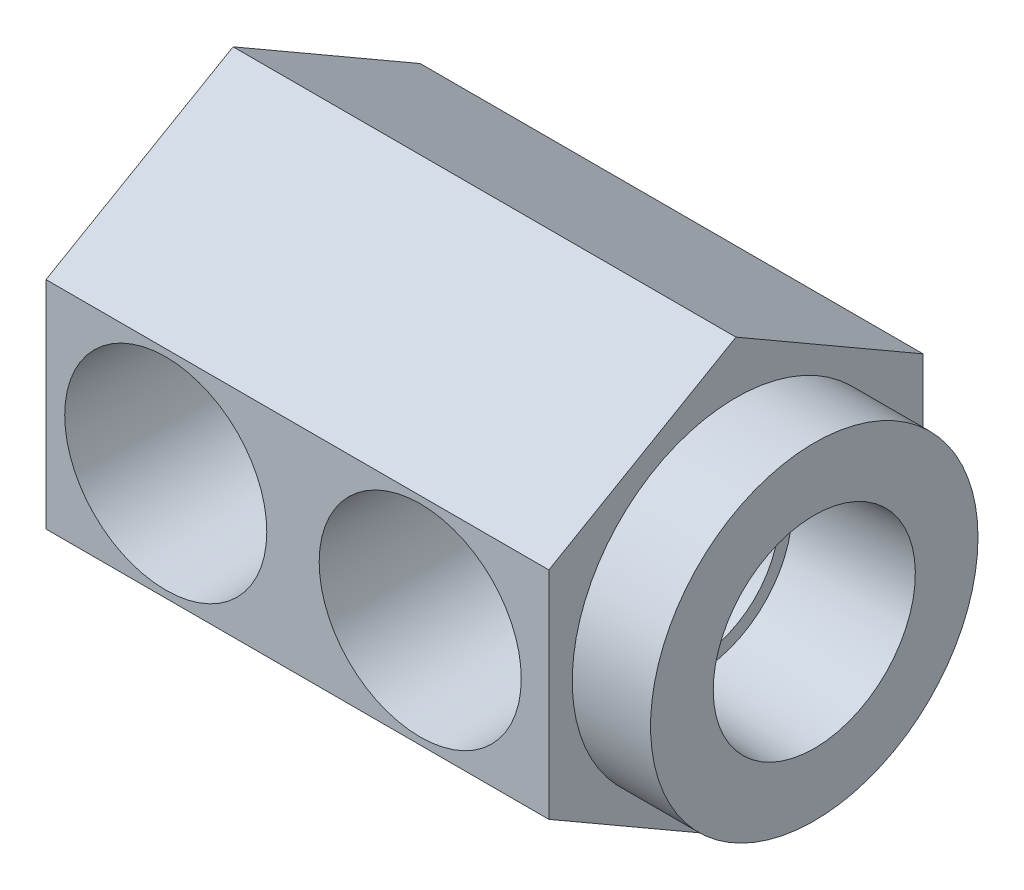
ISO-10303-21;
HEADER;
FILE_DESCRIPTION(('STEP AP214'),'2;1');
FILE_NAME('part.step','',(''),(''),'','','');
FILE_SCHEMA(('AUTOMOTIVE_DESIGN { 1 0 10303 214 1 1 1 1 }'));
ENDSEC;
DATA;
#1=APPLICATION_CONTEXT('core data for automotive mechanical design processes');
#2=APPLICATION_PROTOCOL_DEFINITION('international standard','automotive_design',2000,#1);
#3=PRODUCT_CONTEXT('',#1,'mechanical');
#4=PRODUCT('Part','Part','',(#3));
#5=PRODUCT_RELATED_PRODUCT_CATEGORY('part','',(#4));
#6=PRODUCT_DEFINITION_FORMATION('','',#4);
#7=PRODUCT_DEFINITION_CONTEXT('part definition',#1,'design');
#8=PRODUCT_DEFINITION('design','',#6,#7);
#9=PRODUCT_DEFINITION_SHAPE('','',#8);
#10=(LENGTH_UNIT() NAMED_UNIT(*) SI_UNIT(.MILLI.,.METRE.));
#11=(NAMED_UNIT(*) PLANE_ANGLE_UNIT() SI_UNIT($,.RADIAN.));
#12=(NAMED_UNIT(*) SI_UNIT($,.STERADIAN.) SOLID_ANGLE_UNIT());
#13=UNCERTAINTY_MEASURE_WITH_UNIT(LENGTH_MEASURE(1.E-05),#10,'distance_accuracy_value','');
#14=(GEOMETRIC_REPRESENTATION_CONTEXT(3) GLOBAL_UNCERTAINTY_ASSIGNED_CONTEXT((#13)) GLOBAL_UNIT_ASSIGNED_CONTEXT((#10,
#11,#12)) REPRESENTATION_CONTEXT('',''));
#15=CARTESIAN_POINT('',(0.,0.,0.));
#16=DIRECTION('',(0.,0.,1.));
#17=DIRECTION('',(1.,0.,0.));
#18=AXIS2_PLACEMENT_3D('',#15,#16,#17);
#19=CARTESIAN_POINT('',(30.9626,0.,2.6797));
#20=DIRECTION('',(0.,0.,-1.));
#21=DIRECTION('',(-1.,0.,0.));
#22=AXIS2_PLACEMENT_3D('',#19,#20,#21);
#23=PLANE('',#22);
#24=CARTESIAN_POINT('',(25.4,0.,2.6797));
#25=DIRECTION('',(0.,0.,1.));
#26=DIRECTION('',(1.,0.,0.));
#27=AXIS2_PLACEMENT_3D('',#24,#25,#26);
#28=CIRCLE('',#27,6.55797879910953);
#29=CARTESIAN_POINT('',(29.92247,4.74914213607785,2.6797));
#30=VERTEX_POINT('',#29);
#31=CARTESIAN_POINT('',(19.0669712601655,1.70288957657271,2.6797));
#32=VERTEX_POINT('',#31);
#33=EDGE_CURVE('E179',#30,#32,#28,.T.);
#34=ORIENTED_EDGE('',*,*,#33,.T.);
#35=DIRECTION('',(1.,0.,0.));
#36=VECTOR('',#35,1.);
#37=CARTESIAN_POINT('',(39.44747,1.70288957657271,2.6797));
#38=LINE('',#37,#36);
#39=CARTESIAN_POINT('',(20.1044654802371,1.70288957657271,2.6797));
#40=VERTEX_POINT('',#39);
#41=EDGE_CURVE('E50',#32,#40,#38,.T.);
#42=ORIENTED_EDGE('',*,*,#41,.T.);
#43=CARTESIAN_POINT('',(25.4,0.,2.6797));
#44=DIRECTION('',(0.,0.,1.));
#45=DIRECTION('',(1.,0.,0.));
#46=AXIS2_PLACEMENT_3D('',#43,#44,#45);
#47=CIRCLE('',#46,5.56260000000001);
#48=CARTESIAN_POINT('',(29.92247,3.23879358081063,2.6797));
#49=VERTEX_POINT('',#48);
#50=EDGE_CURVE('E187',#49,#40,#47,.T.);
#51=ORIENTED_EDGE('',*,*,#50,.F.);
#52=DIRECTION('',(0.,1.,0.));
#53=VECTOR('',#52,1.);
#54=CARTESIAN_POINT('',(29.92247,0.,2.6797));
#55=LINE('',#54,#53);
#56=EDGE_CURVE('E322',#49,#30,#55,.T.);
#57=ORIENTED_EDGE('',*,*,#56,.T.);
#58=EDGE_LOOP('',(#34,#42,#51,#57));
#59=FACE_BOUND('',#58,.T.);
#60=ADVANCED_FACE('F34',(#59),#23,.F.);
#61=CARTESIAN_POINT('',(39.44747,0.,0.));
#62=DIRECTION('',(1.,0.,0.));
#63=DIRECTION('',(0.,0.,-1.));
#64=AXIS2_PLACEMENT_3D('',#61,#62,#63);
#65=PLANE('',#64);
#66=CARTESIAN_POINT('',(39.44747,0.,0.));
#67=DIRECTION('',(1.,0.,0.));
#68=DIRECTION('',(0.,0.,-1.));
#69=AXIS2_PLACEMENT_3D('',#66,#67,#68);
#70=CIRCLE('',#69,11.1125);
#71=CARTESIAN_POINT('',(39.44747,0.,-11.1125));
#72=VERTEX_POINT('',#71);
#73=EDGE_CURVE('E273',#72,#72,#70,.T.);
#74=ORIENTED_EDGE('',*,*,#73,.T.);
#75=EDGE_LOOP('',(#74));
#76=FACE_BOUND('',#75,.T.);
#77=CARTESIAN_POINT('',(39.44747,0.,0.));
#78=DIRECTION('',(-1.,0.,0.));
#79=DIRECTION('',(0.,0.,1.));
#80=AXIS2_PLACEMENT_3D('',#77,#78,#79);
#81=CIRCLE('',#80,6.85927);
#82=CARTESIAN_POINT('',(39.44747,0.,6.85927));
#83=VERTEX_POINT('',#82);
#84=EDGE_CURVE('E269',#83,#83,#81,.T.);
#85=ORIENTED_EDGE('',*,*,#84,.T.);
#86=EDGE_LOOP('',(#85));
#87=FACE_BOUND('',#86,.T.);
#88=ADVANCED_FACE('F416',(#76,#87),#65,.T.);
#89=CARTESIAN_POINT('',(34.13125,-7.33234841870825,12.7));
#90=DIRECTION('',(1.,0.,0.));
#91=DIRECTION('',(0.,0.,-1.));
#92=AXIS2_PLACEMENT_3D('',#89,#90,#91);
#93=PLANE('',#92);
#94=DIRECTION('',(0.,-1.,0.));
#95=VECTOR('',#94,1.);
#96=CARTESIAN_POINT('',(34.13125,7.33234841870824,12.7));
#97=LINE('',#96,#95);
#98=CARTESIAN_POINT('',(34.13125,7.33234841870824,12.7));
#99=VERTEX_POINT('',#98);
#100=CARTESIAN_POINT('',(34.13125,-7.33234841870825,12.7));
#101=VERTEX_POINT('',#100);
#102=EDGE_CURVE('E279',#99,#101,#97,.T.);
#103=ORIENTED_EDGE('',*,*,#102,.T.);
#104=DIRECTION('',(0.,-0.5,-0.866025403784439));
#105=VECTOR('',#104,1.);
#106=CARTESIAN_POINT('',(34.13125,-7.33234841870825,12.7));
#107=LINE('',#106,#105);
#108=CARTESIAN_POINT('',(34.13125,-14.6646968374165,0.));
#109=VERTEX_POINT('',#108);
#110=EDGE_CURVE('E282',#101,#109,#107,.T.);
#111=ORIENTED_EDGE('',*,*,#110,.T.);
#112=DIRECTION('',(0.,0.500000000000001,-0.866025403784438));
#113=VECTOR('',#112,1.);
#114=CARTESIAN_POINT('',(34.13125,-14.6646968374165,0.));
#115=LINE('',#114,#113);
#116=CARTESIAN_POINT('',(34.13125,-7.33234841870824,-12.7));
#117=VERTEX_POINT('',#116);
#118=EDGE_CURVE('E285',#109,#117,#115,.T.);
#119=ORIENTED_EDGE('',*,*,#118,.T.);
#120=DIRECTION('',(0.,1.,0.));
#121=VECTOR('',#120,1.);
#122=CARTESIAN_POINT('',(34.13125,-7.33234841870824,-12.7));
#123=LINE('',#122,#121);
#124=CARTESIAN_POINT('',(34.13125,7.33234841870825,-12.7));
#125=VERTEX_POINT('',#124);
#126=EDGE_CURVE('E287',#117,#125,#123,.T.);
#127=ORIENTED_EDGE('',*,*,#126,.T.);
#128=DIRECTION('',(0.,0.5,0.866025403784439));
#129=VECTOR('',#128,1.);
#130=CARTESIAN_POINT('',(34.13125,7.33234841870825,-12.7));
#131=LINE('',#130,#129);
#132=CARTESIAN_POINT('',(34.13125,14.6646968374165,0.));
#133=VERTEX_POINT('',#132);
#134=EDGE_CURVE('E289',#125,#133,#131,.T.);
#135=ORIENTED_EDGE('',*,*,#134,.T.);
#136=DIRECTION('',(0.,-0.5,0.866025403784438));
#137=VECTOR('',#136,1.);
#138=CARTESIAN_POINT('',(34.13125,14.6646968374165,0.));
#139=LINE('',#138,#137);
#140=EDGE_CURVE('E291',#133,#99,#139,.T.);
#141=ORIENTED_EDGE('',*,*,#140,.T.);
#142=EDGE_LOOP('',(#103,#111,#119,#127,#135,#141));
#143=FACE_BOUND('',#142,.T.);
#144=CARTESIAN_POINT('',(34.13125,0.,0.));
#145=DIRECTION('',(1.,0.,0.));
#146=DIRECTION('',(0.,0.,-1.));
#147=AXIS2_PLACEMENT_3D('',#144,#145,#146);
#148=CIRCLE('',#147,11.1125);
#149=CARTESIAN_POINT('',(34.13125,0.,-11.1125));
#150=VERTEX_POINT('',#149);
#151=EDGE_CURVE('E272',#150,#150,#148,.T.);
#152=ORIENTED_EDGE('',*,*,#151,.F.);
#153=EDGE_LOOP('',(#152));
#154=FACE_BOUND('',#153,.T.);
#155=ADVANCED_FACE('F420',(#143,#154),#93,.T.);
#156=CARTESIAN_POINT('',(34.13125,7.33234841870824,12.7));
#157=DIRECTION('',(0.,0.,-1.));
#158=DIRECTION('',(0.,1.,0.));
#159=AXIS2_PLACEMENT_3D('',#156,#157,#158);
#160=PLANE('',#159);
#161=CARTESIAN_POINT('',(8.128,0.,12.7));
#162=DIRECTION('',(0.,0.,1.));
#163=DIRECTION('',(1.,0.,0.));
#164=AXIS2_PLACEMENT_3D('',#161,#162,#163);
#165=CIRCLE('',#164,6.858);
#166=CARTESIAN_POINT('',(14.986,0.,12.7));
#167=VERTEX_POINT('',#166);
#168=EDGE_CURVE('E367',#167,#167,#165,.T.);
#169=ORIENTED_EDGE('',*,*,#168,.F.);
#170=EDGE_LOOP('',(#169));
#171=FACE_BOUND('',#170,.T.);
#172=CARTESIAN_POINT('',(25.4,0.,12.7));
#173=DIRECTION('',(0.,0.,1.));
#174=DIRECTION('',(1.,0.,0.));
#175=AXIS2_PLACEMENT_3D('',#172,#173,#174);
#176=CIRCLE('',#175,6.858);
#177=CARTESIAN_POINT('',(32.258,0.,12.7));
#178=VERTEX_POINT('',#177);
#179=EDGE_CURVE('E180',#178,#178,#176,.T.);
#180=ORIENTED_EDGE('',*,*,#179,.F.);
#181=EDGE_LOOP('',(#180));
#182=FACE_BOUND('',#181,.T.);
#183=DIRECTION('',(0.,-1.,0.));
#184=VECTOR('',#183,1.);
#185=CARTESIAN_POINT('',(0.,7.33234841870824,12.7));
#186=LINE('',#185,#184);
#187=CARTESIAN_POINT('',(0.,7.33234841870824,12.7));
#188=VERTEX_POINT('',#187);
#189=CARTESIAN_POINT('',(0.,-7.33234841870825,12.7));
#190=VERTEX_POINT('',#189);
#191=EDGE_CURVE('E276',#188,#190,#186,.T.);
#192=ORIENTED_EDGE('',*,*,#191,.T.);
#193=DIRECTION('',(-1.,0.,0.));
#194=VECTOR('',#193,1.);
#195=CARTESIAN_POINT('',(34.13125,-7.33234841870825,12.7));
#196=LINE('',#195,#194);
#197=EDGE_CURVE('E318',#101,#190,#196,.T.);
#198=ORIENTED_EDGE('',*,*,#197,.F.);
#199=ORIENTED_EDGE('',*,*,#102,.F.);
#200=DIRECTION('',(-1.,0.,0.));
#201=VECTOR('',#200,1.);
#202=CARTESIAN_POINT('',(34.13125,7.33234841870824,12.7));
#203=LINE('',#202,#201);
#204=EDGE_CURVE('E293',#99,#188,#203,.T.);
#205=ORIENTED_EDGE('',*,*,#204,.T.);
#206=EDGE_LOOP('',(#192,#198,#199,#205));
#207=FACE_BOUND('',#206,.T.);
#208=ADVANCED_FACE('F36',(#171,#182,#207),#160,.F.);
#209=CARTESIAN_POINT('',(34.13125,-7.33234841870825,12.7));
#210=DIRECTION('',(0.,0.866025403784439,-0.5));
#211=DIRECTION('',(0.,0.5,0.866025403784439));
#212=AXIS2_PLACEMENT_3D('',#209,#210,#211);
#213=PLANE('',#212);
#214=DIRECTION('',(0.,-0.5,-0.866025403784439));
#215=VECTOR('',#214,1.);
#216=CARTESIAN_POINT('',(0.,-7.33234841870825,12.7));
#217=LINE('',#216,#215);
#218=CARTESIAN_POINT('',(0.,-14.6646968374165,0.));
#219=VERTEX_POINT('',#218);
#220=EDGE_CURVE('E296',#190,#219,#217,.T.);
#221=ORIENTED_EDGE('',*,*,#220,.T.);
#222=DIRECTION('',(-1.,0.,0.));
#223=VECTOR('',#222,1.);
#224=CARTESIAN_POINT('',(34.13125,-14.6646968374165,0.));
#225=LINE('',#224,#223);
#226=EDGE_CURVE('E316',#109,#219,#225,.T.);
#227=ORIENTED_EDGE('',*,*,#226,.F.);
#228=ORIENTED_EDGE('',*,*,#110,.F.);
#229=ORIENTED_EDGE('',*,*,#197,.T.);
#230=EDGE_LOOP('',(#221,#227,#228,#229));
#231=FACE_BOUND('',#230,.T.);
#232=ADVANCED_FACE('F479',(#231),#213,.F.);
#233=CARTESIAN_POINT('',(34.13125,-14.6646968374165,0.));
#234=DIRECTION('',(0.,0.866025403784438,0.500000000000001));
#235=DIRECTION('',(0.,-0.500000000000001,0.866025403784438));
#236=AXIS2_PLACEMENT_3D('',#233,#234,#235);
#237=PLANE('',#236);
#238=DIRECTION('',(0.,0.500000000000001,-0.866025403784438));
#239=VECTOR('',#238,1.);
#240=CARTESIAN_POINT('',(0.,-14.6646968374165,0.));
#241=LINE('',#240,#239);
#242=CARTESIAN_POINT('',(0.,-7.33234841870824,-12.7));
#243=VERTEX_POINT('',#242);
#244=EDGE_CURVE('E298',#219,#243,#241,.T.);
#245=ORIENTED_EDGE('',*,*,#244,.T.);
#246=DIRECTION('',(-1.,0.,0.));
#247=VECTOR('',#246,1.);
#248=CARTESIAN_POINT('',(34.13125,-7.33234841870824,-12.7));
#249=LINE('',#248,#247);
#250=EDGE_CURVE('E313',#117,#243,#249,.T.);
#251=ORIENTED_EDGE('',*,*,#250,.F.);
#252=ORIENTED_EDGE('',*,*,#118,.F.);
#253=ORIENTED_EDGE('',*,*,#226,.T.);
#254=EDGE_LOOP('',(#245,#251,#252,#253));
#255=FACE_BOUND('',#254,.T.);
#256=ADVANCED_FACE('F476',(#255),#237,.F.);
#257=CARTESIAN_POINT('',(34.13125,-7.33234841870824,-12.7));
#258=DIRECTION('',(0.,0.,1.));
#259=DIRECTION('',(0.,-1.,0.));
#260=AXIS2_PLACEMENT_3D('',#257,#258,#259);
#261=PLANE('',#260);
#262=CARTESIAN_POINT('',(8.128,0.,-12.7));
#263=DIRECTION('',(0.,0.,-1.));
#264=DIRECTION('',(0.,1.,0.));
#265=AXIS2_PLACEMENT_3D('',#262,#263,#264);
#266=CIRCLE('',#265,6.858);
#267=CARTESIAN_POINT('',(8.128,6.858,-12.7));
#268=VERTEX_POINT('',#267);
#269=EDGE_CURVE('E251',#268,#268,#266,.T.);
#270=ORIENTED_EDGE('',*,*,#269,.F.);
#271=EDGE_LOOP('',(#270));
#272=FACE_BOUND('',#271,.T.);
#273=DIRECTION('',(0.,1.,0.));
#274=VECTOR('',#273,1.);
#275=CARTESIAN_POINT('',(0.,-7.33234841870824,-12.7));
#276=LINE('',#275,#274);
#277=CARTESIAN_POINT('',(0.,7.33234841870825,-12.7));
#278=VERTEX_POINT('',#277);
#279=EDGE_CURVE('E300',#243,#278,#276,.T.);
#280=ORIENTED_EDGE('',*,*,#279,.T.);
#281=DIRECTION('',(-1.,0.,0.));
#282=VECTOR('',#281,1.);
#283=CARTESIAN_POINT('',(34.13125,7.33234841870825,-12.7));
#284=LINE('',#283,#282);
#285=EDGE_CURVE('E310',#125,#278,#284,.T.);
#286=ORIENTED_EDGE('',*,*,#285,.F.);
#287=ORIENTED_EDGE('',*,*,#126,.F.);
#288=ORIENTED_EDGE('',*,*,#250,.T.);
#289=EDGE_LOOP('',(#280,#286,#287,#288));
#290=FACE_BOUND('',#289,.T.);
#291=ADVANCED_FACE('F472',(#272,#290),#261,.F.);
#292=CARTESIAN_POINT('',(34.13125,7.33234841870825,-12.7));
#293=DIRECTION('',(0.,-0.866025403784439,0.5));
#294=DIRECTION('',(0.,-0.5,-0.866025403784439));
#295=AXIS2_PLACEMENT_3D('',#292,#293,#294);
#296=PLANE('',#295);
#297=DIRECTION('',(0.,0.5,0.866025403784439));
#298=VECTOR('',#297,1.);
#299=CARTESIAN_POINT('',(0.,7.33234841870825,-12.7));
#300=LINE('',#299,#298);
#301=CARTESIAN_POINT('',(0.,14.6646968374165,0.));
#302=VERTEX_POINT('',#301);
#303=EDGE_CURVE('E302',#278,#302,#300,.T.);
#304=ORIENTED_EDGE('',*,*,#303,.T.);
#305=DIRECTION('',(-1.,0.,0.));
#306=VECTOR('',#305,1.);
#307=CARTESIAN_POINT('',(34.13125,14.6646968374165,0.));
#308=LINE('',#307,#306);
#309=EDGE_CURVE('E307',#133,#302,#308,.T.);
#310=ORIENTED_EDGE('',*,*,#309,.F.);
#311=ORIENTED_EDGE('',*,*,#134,.F.);
#312=ORIENTED_EDGE('',*,*,#285,.T.);
#313=EDGE_LOOP('',(#304,#310,#311,#312));
#314=FACE_BOUND('',#313,.T.);
#315=ADVANCED_FACE('F468',(#314),#296,.F.);
#316=CARTESIAN_POINT('',(34.13125,14.6646968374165,0.));
#317=DIRECTION('',(0.,-0.866025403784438,-0.5));
#318=DIRECTION('',(0.,0.5,-0.866025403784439));
#319=AXIS2_PLACEMENT_3D('',#316,#317,#318);
#320=PLANE('',#319);
#321=DIRECTION('',(0.,-0.5,0.866025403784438));
#322=VECTOR('',#321,1.);
#323=CARTESIAN_POINT('',(0.,14.6646968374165,0.));
#324=LINE('',#323,#322);
#325=EDGE_CURVE('E283',#302,#188,#324,.T.);
#326=ORIENTED_EDGE('',*,*,#325,.T.);
#327=ORIENTED_EDGE('',*,*,#204,.F.);
#328=ORIENTED_EDGE('',*,*,#140,.F.);
#329=ORIENTED_EDGE('',*,*,#309,.T.);
#330=EDGE_LOOP('',(#326,#327,#328,#329));
#331=FACE_BOUND('',#330,.T.);
#332=ADVANCED_FACE('F464',(#331),#320,.F.);
#333=CARTESIAN_POINT('',(0.,-7.33234841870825,12.7));
#334=DIRECTION('',(1.,0.,0.));
#335=DIRECTION('',(0.,0.,-1.));
#336=AXIS2_PLACEMENT_3D('',#333,#334,#335);
#337=PLANE('',#336);
#338=ORIENTED_EDGE('',*,*,#191,.F.);
#339=ORIENTED_EDGE('',*,*,#325,.F.);
#340=ORIENTED_EDGE('',*,*,#303,.F.);
#341=ORIENTED_EDGE('',*,*,#279,.F.);
#342=ORIENTED_EDGE('',*,*,#244,.F.);
#343=ORIENTED_EDGE('',*,*,#220,.F.);
#344=EDGE_LOOP('',(#338,#339,#340,#341,#342,#343));
#345=FACE_BOUND('',#344,.T.);
#346=ADVANCED_FACE('F453',(#345),#337,.F.);
#347=CARTESIAN_POINT('',(39.44747,0.,0.));
#348=DIRECTION('',(-1.,0.,0.));
#349=DIRECTION('',(0.,0.,1.));
#350=AXIS2_PLACEMENT_3D('',#347,#348,#349);
#351=CYLINDRICAL_SURFACE('',#350,11.1125);
#352=ORIENTED_EDGE('',*,*,#73,.F.);
#353=EDGE_LOOP('',(#352));
#354=FACE_BOUND('',#353,.T.);
#355=ORIENTED_EDGE('',*,*,#151,.T.);
#356=EDGE_LOOP('',(#355));
#357=FACE_BOUND('',#356,.T.);
#358=ADVANCED_FACE('F446',(#354,#357),#351,.T.);
#359=CARTESIAN_POINT('',(39.44747,0.,0.));
#360=DIRECTION('',(1.,0.,0.));
#361=DIRECTION('',(0.,0.,-1.));
#362=AXIS2_PLACEMENT_3D('',#359,#360,#361);
#363=CONICAL_SURFACE('',#362,6.85927,0.0523598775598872);
#364=CARTESIAN_POINT('',(31.434967,2.79651950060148,5.80040855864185));
#365=CARTESIAN_POINT('',(31.4885738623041,2.68491125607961,5.85734580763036));
#366=CARTESIAN_POINT('',(31.5395481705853,2.57051306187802,5.9113986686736));
#367=CARTESIAN_POINT('',(31.6356400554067,2.33643131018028,6.01316652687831));
#368=CARTESIAN_POINT('',(31.6807526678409,2.21674338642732,6.06087615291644));
#369=CARTESIAN_POINT('',(31.7646308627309,1.97200075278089,6.14949518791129));
#370=CARTESIAN_POINT('',(31.8033661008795,1.84692376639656,6.19037209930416));
#371=CARTESIAN_POINT('',(31.8736020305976,1.59255780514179,6.2644343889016));
#372=CARTESIAN_POINT('',(31.9051046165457,1.46326994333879,6.29762178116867));
#373=CARTESIAN_POINT('',(31.9604703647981,1.20051379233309,6.35591633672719));
#374=CARTESIAN_POINT('',(31.9842919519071,1.06702690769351,6.380979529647));
#375=CARTESIAN_POINT('',(32.0235910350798,0.797488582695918,6.42231247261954));
#376=CARTESIAN_POINT('',(32.0390691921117,0.661437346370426,6.43858291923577));
#377=CARTESIAN_POINT('',(32.0613239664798,0.388244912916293,6.46197333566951));
#378=CARTESIAN_POINT('',(32.0681260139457,0.25110809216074,6.46912004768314));
#379=CARTESIAN_POINT('',(32.0729626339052,-0.0234825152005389,6.47420197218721));
#380=CARTESIAN_POINT('',(32.0709980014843,-0.160936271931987,6.47213802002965));
#381=CARTESIAN_POINT('',(32.058806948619,-0.425053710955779,6.45932755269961));
#382=CARTESIAN_POINT('',(32.0491894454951,-0.551777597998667,6.44922096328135));
#383=CARTESIAN_POINT('',(32.0226279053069,-0.80364039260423,6.42129811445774));
#384=CARTESIAN_POINT('',(32.005681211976,-0.928778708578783,6.40347905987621));
#385=CARTESIAN_POINT('',(31.964723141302,-1.17682126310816,6.36038910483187));
#386=CARTESIAN_POINT('',(31.9406993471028,-1.29972116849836,6.33510510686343));
#387=CARTESIAN_POINT('',(31.8860008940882,-1.54235323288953,6.27749566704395));
#388=CARTESIAN_POINT('',(31.8553245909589,-1.66208460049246,6.24516848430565));
#389=CARTESIAN_POINT('',(31.7700806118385,-1.95951809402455,6.15525600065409));
#390=CARTESIAN_POINT('',(31.7114113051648,-2.13476678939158,6.09330594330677));
#391=CARTESIAN_POINT('',(31.6141871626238,-2.38938982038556,5.9904492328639));
#392=CARTESIAN_POINT('',(31.5803287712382,-2.47271111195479,5.95460001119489));
#393=CARTESIAN_POINT('',(31.5097463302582,-2.63664903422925,5.87978975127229));
#394=CARTESIAN_POINT('',(31.4730236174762,-2.71726690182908,5.84083016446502));
#395=CARTESIAN_POINT('',(31.434967,-2.79651950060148,5.80040855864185));
#396=B_SPLINE_CURVE_WITH_KNOTS('',3,(#364,#365,#366,#367,#368,#369,#370,#371,#372,#373,#374,
#375,#376,#377,#378,#379,#380,#381,#382,#383,#384,#385,#386,#387,#388,#389,#390,#391,#392,#393,
#394,#395),.UNSPECIFIED.,.F.,.F.,(4,2,2,2,2,2,2,2,2,2,2,2,2,2,2,4),(0.,0.408818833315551,
0.817981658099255,1.22903833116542,1.6399872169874,2.05312450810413,2.46622906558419,
2.87811998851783,3.28997355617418,3.6719864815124,4.05413797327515,4.43696398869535,
4.81988473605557,5.4031989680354,5.69355402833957,5.98377437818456),.UNSPECIFIED.);
#397=CARTESIAN_POINT('',(31.50997,2.63463996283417,5.88001456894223));
#398=VERTEX_POINT('',#397);
#399=CARTESIAN_POINT('',(31.50997,-2.63463996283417,5.88001456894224));
#400=VERTEX_POINT('',#399);
#401=EDGE_CURVE('E235',#398,#400,#396,.T.);
#402=ORIENTED_EDGE('',*,*,#401,.F.);
#403=CARTESIAN_POINT('',(31.50997,0.,0.));
#404=DIRECTION('',(-1.,0.,0.));
#405=DIRECTION('',(0.,0.,1.));
#406=AXIS2_PLACEMENT_3D('',#403,#404,#405);
#407=CIRCLE('',#406,6.4432832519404);
#408=EDGE_CURVE('E266',#398,#400,#407,.T.);
#409=ORIENTED_EDGE('',*,*,#408,.T.);
#410=EDGE_LOOP('',(#402,#409));
#411=FACE_BOUND('',#410,.T.);
#412=ORIENTED_EDGE('',*,*,#84,.F.);
#413=EDGE_LOOP('',(#412));
#414=FACE_BOUND('',#413,.T.);
#415=ADVANCED_FACE('F443',(#411,#414),#363,.F.);
#416=CARTESIAN_POINT('',(31.50997,0.,-5.55625));
#417=DIRECTION('',(1.,0.,0.));
#418=DIRECTION('',(0.,0.,-1.));
#419=AXIS2_PLACEMENT_3D('',#416,#417,#418);
#420=PLANE('',#419);
#421=CARTESIAN_POINT('',(31.50997,-3.40485172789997,17.2630170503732));
#422=CARTESIAN_POINT('',(31.50997,-3.33912103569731,16.1949703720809));
#423=CARTESIAN_POINT('',(31.50997,-3.27201398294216,15.127006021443));
#424=CARTESIAN_POINT('',(31.50997,-3.13431515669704,12.991328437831));
#425=CARTESIAN_POINT('',(31.50997,-3.06372346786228,11.923615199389));
#426=CARTESIAN_POINT('',(31.50997,-2.91834199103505,9.78879369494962));
#427=CARTESIAN_POINT('',(31.50997,-2.84355346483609,8.72168534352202));
#428=CARTESIAN_POINT('',(31.50997,-2.68864021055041,6.58782277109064));
#429=CARTESIAN_POINT('',(31.50997,-2.60851532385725,5.52106856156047));
#430=CARTESIAN_POINT('',(31.50997,-2.44128073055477,3.3876946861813));
#431=CARTESIAN_POINT('',(31.50997,-2.35416839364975,2.32107522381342));
#432=CARTESIAN_POINT('',(31.50997,-2.21624588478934,0.721810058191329));
#433=CARTESIAN_POINT('',(31.50997,-2.16906454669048,0.188851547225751));
#434=CARTESIAN_POINT('',(31.50997,-2.07174805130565,-0.87680396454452));
#435=CARTESIAN_POINT('',(31.50997,-2.02161285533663,-1.40950096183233));
#436=CARTESIAN_POINT('',(31.50997,-1.91766350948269,-2.47471868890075));
#437=CARTESIAN_POINT('',(31.50997,-1.863848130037,-3.00723929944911));
#438=CARTESIAN_POINT('',(31.50997,-1.75150147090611,-4.07176620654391));
#439=CARTESIAN_POINT('',(31.50997,-1.69297035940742,-4.60377252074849));
#440=CARTESIAN_POINT('',(31.50997,-1.569551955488,-5.66718749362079));
#441=CARTESIAN_POINT('',(31.50997,-1.50466316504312,-6.19859598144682));
#442=CARTESIAN_POINT('',(31.50997,-1.40040042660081,-6.99483769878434));
#443=CARTESIAN_POINT('',(31.50997,-1.36448891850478,-7.26012215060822));
#444=CARTESIAN_POINT('',(31.50997,-1.28967950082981,-7.79027968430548));
#445=CARTESIAN_POINT('',(31.50997,-1.25078146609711,-8.05515274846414));
#446=CARTESIAN_POINT('',(31.50997,-1.21005294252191,-8.31975375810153));
#447=B_SPLINE_CURVE_WITH_KNOTS('',3,(#421,#422,#423,#424,#425,#426,#427,#428,#429,#430,#431,
#432,#433,#434,#435,#436,#437,#438,#439,#440,#441,#442,#443,#444,#445,#446),.UNSPECIFIED.,.F.,
.F.,(4,2,2,2,2,2,2,2,2,2,2,2,4),(0.,3.21020479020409,6.42033163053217,9.62949845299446,
12.8387607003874,16.0492367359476,17.654358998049,19.2595022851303,20.8651845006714,
22.470809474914,24.0768136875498,24.8799111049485,25.6830421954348),.UNSPECIFIED.);
#448=CARTESIAN_POINT('',(31.50997,-2.56197927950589,4.93033226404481));
#449=VERTEX_POINT('',#448);
#450=EDGE_CURVE('E241',#400,#449,#447,.T.);
#451=ORIENTED_EDGE('',*,*,#450,.F.);
#452=ORIENTED_EDGE('',*,*,#408,.F.);
#453=CARTESIAN_POINT('',(31.50997,1.21005294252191,-8.31975375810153));
#454=CARTESIAN_POINT('',(31.50997,1.25078146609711,-8.05515274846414));
#455=CARTESIAN_POINT('',(31.50997,1.28967950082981,-7.79027968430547));
#456=CARTESIAN_POINT('',(31.50997,1.36448891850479,-7.26012215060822));
#457=CARTESIAN_POINT('',(31.50997,1.40040042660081,-6.99483769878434));
#458=CARTESIAN_POINT('',(31.50997,1.50466316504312,-6.19859598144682));
#459=CARTESIAN_POINT('',(31.50997,1.569551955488,-5.6671874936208));
#460=CARTESIAN_POINT('',(31.50997,1.69297035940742,-4.60377252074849));
#461=CARTESIAN_POINT('',(31.50997,1.75150147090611,-4.07176620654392));
#462=CARTESIAN_POINT('',(31.50997,1.863848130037,-3.00723929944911));
#463=CARTESIAN_POINT('',(31.50997,1.91766350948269,-2.47471868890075));
#464=CARTESIAN_POINT('',(31.50997,2.02161285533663,-1.40950096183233));
#465=CARTESIAN_POINT('',(31.50997,2.07174805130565,-0.87680396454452));
#466=CARTESIAN_POINT('',(31.50997,2.16906454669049,0.188851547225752));
#467=CARTESIAN_POINT('',(31.50997,2.21624588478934,0.721810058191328));
#468=CARTESIAN_POINT('',(31.50997,2.35416839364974,2.32107522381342));
#469=CARTESIAN_POINT('',(31.50997,2.44128073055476,3.3876946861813));
#470=CARTESIAN_POINT('',(31.50997,2.60851532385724,5.52106856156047));
#471=CARTESIAN_POINT('',(31.50997,2.6886402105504,6.58782277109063));
#472=CARTESIAN_POINT('',(31.50997,2.8435534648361,8.72168534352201));
#473=CARTESIAN_POINT('',(31.50997,2.91834199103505,9.78879369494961));
#474=CARTESIAN_POINT('',(31.50997,3.06372346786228,11.923615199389));
#475=CARTESIAN_POINT('',(31.50997,3.13431515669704,12.991328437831));
#476=CARTESIAN_POINT('',(31.50997,3.27201398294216,15.127006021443));
#477=CARTESIAN_POINT('',(31.50997,3.33912103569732,16.1949703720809));
#478=CARTESIAN_POINT('',(31.50997,3.40485172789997,17.2630170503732));
#479=B_SPLINE_CURVE_WITH_KNOTS('',3,(#453,#454,#455,#456,#457,#458,#459,#460,#461,#462,#463,
#464,#465,#466,#467,#468,#469,#470,#471,#472,#473,#474,#475,#476,#477,#478),.UNSPECIFIED.,.F.,
.F.,(4,2,2,2,2,2,2,2,2,2,2,2,4),(0.,0.80313109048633,1.606228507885,3.21223272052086,
4.81785769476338,6.42353991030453,8.02868319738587,9.63380545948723,12.8442814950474,
16.0535437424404,19.2627105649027,22.4728374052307,25.6830421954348),.UNSPECIFIED.);
#480=CARTESIAN_POINT('',(31.50997,2.5619792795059,4.93033226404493));
#481=VERTEX_POINT('',#480);
#482=EDGE_CURVE('E200',#481,#398,#479,.T.);
#483=ORIENTED_EDGE('',*,*,#482,.F.);
#484=CARTESIAN_POINT('',(31.50997,0.,0.));
#485=DIRECTION('',(-1.,0.,0.));
#486=DIRECTION('',(0.,0.,1.));
#487=AXIS2_PLACEMENT_3D('',#484,#485,#486);
#488=CIRCLE('',#487,5.55625);
#489=EDGE_CURVE('E263',#481,#449,#488,.T.);
#490=ORIENTED_EDGE('',*,*,#489,.T.);
#491=EDGE_LOOP('',(#451,#452,#483,#490));
#492=FACE_BOUND('',#491,.T.);
#493=ADVANCED_FACE('F441',(#492),#420,.T.);
#494=CARTESIAN_POINT('',(-12.2161702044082,0.,0.));
#495=DIRECTION('',(-1.,0.,0.));
#496=DIRECTION('',(0.,0.,1.));
#497=AXIS2_PLACEMENT_3D('',#494,#495,#496);
#498=CYLINDRICAL_SURFACE('',#497,5.55625);
#499=CARTESIAN_POINT('',(31.51017,-2.56152070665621,4.93057052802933));
#500=CARTESIAN_POINT('',(31.4436665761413,-2.71404523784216,4.85132005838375));
#501=CARTESIAN_POINT('',(31.3724271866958,-2.86113407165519,4.76593043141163));
#502=CARTESIAN_POINT('',(31.222298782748,-3.14398924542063,4.58426476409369));
#503=CARTESIAN_POINT('',(31.1434194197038,-3.27976947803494,4.48800243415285));
#504=CARTESIAN_POINT('',(30.9812552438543,-3.53740196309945,4.28775051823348));
#505=CARTESIAN_POINT('',(30.8980863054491,-3.65947415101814,4.18394817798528));
#506=CARTESIAN_POINT('',(30.7275112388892,-3.89267876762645,3.96790084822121));
#507=CARTESIAN_POINT('',(30.6401046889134,-4.00381010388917,3.85565501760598));
#508=CARTESIAN_POINT('',(30.4490304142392,-4.23131634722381,3.60564002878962));
#509=CARTESIAN_POINT('',(30.3449139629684,-4.34591093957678,3.46658760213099));
#510=CARTESIAN_POINT('',(30.1873089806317,-4.50762737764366,3.24983980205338));
#511=CARTESIAN_POINT('',(30.1342276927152,-4.56010743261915,3.17578133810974));
#512=CARTESIAN_POINT('',(30.0281182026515,-4.66141056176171,3.02512683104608));
#513=CARTESIAN_POINT('',(29.9750900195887,-4.71023260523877,2.94853008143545));
#514=CARTESIAN_POINT('',(29.92227,-4.75722472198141,2.87066664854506));
#515=B_SPLINE_CURVE_WITH_KNOTS('',3,(#499,#500,#501,#502,#503,#504,#505,#506,#507,#508,#509,
#510,#511,#512,#513,#514),.UNSPECIFIED.,.F.,.F.,(4,2,2,2,2,2,2,4),(0.,0.552446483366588,
1.1042039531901,1.64520405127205,2.186258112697,2.80973715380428,3.1251069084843,
3.4405651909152),.UNSPECIFIED.);
#516=CARTESIAN_POINT('',(29.92247,-4.75704677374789,2.87096152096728));
#517=VERTEX_POINT('',#516);
#518=EDGE_CURVE('E246',#449,#517,#515,.T.);
#519=ORIENTED_EDGE('',*,*,#518,.F.);
#520=ORIENTED_EDGE('',*,*,#489,.F.);
#521=CARTESIAN_POINT('',(29.92227,4.75722472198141,2.87066664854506));
#522=CARTESIAN_POINT('',(29.9714207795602,4.71349676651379,2.94312370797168));
#523=CARTESIAN_POINT('',(30.0207539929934,4.6681825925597,3.01448372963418));
#524=CARTESIAN_POINT('',(30.1195036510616,4.57437090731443,3.15502687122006));
#525=CARTESIAN_POINT('',(30.1689200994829,4.52587324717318,3.22420988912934));
#526=CARTESIAN_POINT('',(30.3169890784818,4.37546886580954,3.42868072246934));
#527=CARTESIAN_POINT('',(30.415335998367,4.26876084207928,3.56070785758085));
#528=CARTESIAN_POINT('',(30.6068647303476,4.04510991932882,3.81270550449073));
#529=CARTESIAN_POINT('',(30.7001132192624,3.92845667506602,3.93288260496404));
#530=CARTESIAN_POINT('',(30.8819101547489,3.68290806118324,4.16370822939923));
#531=CARTESIAN_POINT('',(30.970462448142,3.55402296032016,4.27436459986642));
#532=CARTESIAN_POINT('',(31.1383585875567,3.2882843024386,4.48180571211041));
#533=CARTESIAN_POINT('',(31.2179073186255,3.15182183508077,4.57892274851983));
#534=CARTESIAN_POINT('',(31.3700495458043,2.86603911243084,4.76307965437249));
#535=CARTESIAN_POINT('',(31.4425556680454,2.71659253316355,4.84999518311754));
#536=CARTESIAN_POINT('',(31.51017,2.56152070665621,4.93057052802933));
#537=B_SPLINE_CURVE_WITH_KNOTS('',3,(#521,#522,#523,#524,#525,#526,#527,#528,#529,#530,#531,
#532,#533,#534,#535,#536),.UNSPECIFIED.,.F.,.F.,(4,2,2,2,2,2,2,4),(0.,0.293558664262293,
0.587131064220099,1.17501535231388,1.74946363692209,2.32343386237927,2.87889148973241,
3.44053822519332),.UNSPECIFIED.);
#538=CARTESIAN_POINT('',(29.92247,4.7570467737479,2.87096152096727));
#539=VERTEX_POINT('',#538);
#540=EDGE_CURVE('E193',#539,#481,#537,.T.);
#541=ORIENTED_EDGE('',*,*,#540,.F.);
#542=CARTESIAN_POINT('',(29.92247,0.,0.));
#543=DIRECTION('',(-1.,0.,0.));
#544=DIRECTION('',(0.,0.,1.));
#545=AXIS2_PLACEMENT_3D('',#542,#543,#544);
#546=CIRCLE('',#545,5.55625);
#547=EDGE_CURVE('E260',#539,#517,#546,.T.);
#548=ORIENTED_EDGE('',*,*,#547,.T.);
#549=EDGE_LOOP('',(#519,#520,#541,#548));
#550=FACE_BOUND('',#549,.T.);
#551=ADVANCED_FACE('F206',(#550),#498,.F.);
#552=CARTESIAN_POINT('',(29.92247,0.,-5.55625));
#553=DIRECTION('',(1.,0.,0.));
#554=DIRECTION('',(0.,0.,-1.));
#555=AXIS2_PLACEMENT_3D('',#552,#553,#554);
#556=PLANE('',#555);
#557=CARTESIAN_POINT('',(29.92247,-5.32151301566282,16.8962242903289));
#558=CARTESIAN_POINT('',(29.92247,-5.23763190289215,14.7617339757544));
#559=CARTESIAN_POINT('',(29.92247,-5.15294049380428,12.6272752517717));
#560=CARTESIAN_POINT('',(29.92247,-4.98162940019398,8.35843768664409));
#561=CARTESIAN_POINT('',(29.92247,-4.89500971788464,6.22405884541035));
#562=CARTESIAN_POINT('',(29.92247,-4.71953417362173,1.95539211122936));
#563=CARTESIAN_POINT('',(29.92247,-4.63067831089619,-0.178895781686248));
#564=CARTESIAN_POINT('',(29.92247,-4.45028389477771,-4.44736055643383));
#565=CARTESIAN_POINT('',(29.92247,-4.35874533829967,-6.58153743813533));
#566=CARTESIAN_POINT('',(29.92247,-4.26564226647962,-8.71564669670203));
#567=B_SPLINE_CURVE_WITH_KNOTS('',3,(#557,#558,#559,#560,#561,#562,#563,#564,#565,#566),
.UNSPECIFIED.,.F.,.F.,(4,2,2,2,4),(0.,6.40841377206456,12.8168201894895,19.2252288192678,
25.633644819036),.UNSPECIFIED.);
#568=CARTESIAN_POINT('',(29.92247,-4.74914213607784,2.6797));
#569=VERTEX_POINT('',#568);
#570=EDGE_CURVE('E43',#517,#569,#567,.T.);
#571=ORIENTED_EDGE('',*,*,#570,.F.);
#572=ORIENTED_EDGE('',*,*,#547,.F.);
#573=CARTESIAN_POINT('',(29.92247,4.26564226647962,-8.71564669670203));
#574=CARTESIAN_POINT('',(29.92247,4.35874533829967,-6.58153743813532));
#575=CARTESIAN_POINT('',(29.92247,4.45028389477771,-4.44736055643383));
#576=CARTESIAN_POINT('',(29.92247,4.63067831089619,-0.178895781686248));
#577=CARTESIAN_POINT('',(29.92247,4.71953417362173,1.95539211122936));
#578=CARTESIAN_POINT('',(29.92247,4.89500971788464,6.22405884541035));
#579=CARTESIAN_POINT('',(29.92247,4.98162940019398,8.35843768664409));
#580=CARTESIAN_POINT('',(29.92247,5.15294049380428,12.6272752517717));
#581=CARTESIAN_POINT('',(29.92247,5.23763190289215,14.7617339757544));
#582=CARTESIAN_POINT('',(29.92247,5.32151301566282,16.8962242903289));
#583=B_SPLINE_CURVE_WITH_KNOTS('',3,(#573,#574,#575,#576,#577,#578,#579,#580,#581,#582),
.UNSPECIFIED.,.F.,.F.,(4,2,2,2,4),(0.,6.40841599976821,12.8168246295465,19.2252310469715,
25.633644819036),.UNSPECIFIED.);
#584=EDGE_CURVE('E219',#30,#539,#583,.T.);
#585=ORIENTED_EDGE('',*,*,#584,.F.);
#586=ORIENTED_EDGE('',*,*,#56,.F.);
#587=DIRECTION('',(0.,0.,1.));
#588=VECTOR('',#587,1.);
#589=CARTESIAN_POINT('',(29.92247,3.23879358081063,12.7));
#590=LINE('',#589,#588);
#591=CARTESIAN_POINT('',(29.92247,3.23879358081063,-4.3688));
#592=VERTEX_POINT('',#591);
#593=EDGE_CURVE('E326',#592,#49,#590,.T.);
#594=ORIENTED_EDGE('',*,*,#593,.F.);
#595=CARTESIAN_POINT('',(29.92247,-8.71602218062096,-1.81102098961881));
#596=CARTESIAN_POINT('',(29.92247,-8.50084869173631,-1.92576274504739));
#597=CARTESIAN_POINT('',(29.92247,-8.28531316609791,-2.03983259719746));
#598=CARTESIAN_POINT('',(29.92247,-7.85332975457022,-2.26626874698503));
#599=CARTESIAN_POINT('',(29.92247,-7.6368818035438,-2.37863492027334));
#600=CARTESIAN_POINT('',(29.92247,-7.20233153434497,-2.60158729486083));
#601=CARTESIAN_POINT('',(29.92247,-6.98422632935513,-2.71216788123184));
#602=CARTESIAN_POINT('',(29.92247,-6.54671674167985,-2.93071889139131));
#603=CARTESIAN_POINT('',(29.92247,-6.32731239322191,-3.03868938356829));
#604=CARTESIAN_POINT('',(29.92247,-5.8740316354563,-3.25756931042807));
#605=CARTESIAN_POINT('',(29.92247,-5.640059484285,-3.36828115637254));
#606=CARTESIAN_POINT('',(29.92247,-5.16989173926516,-3.58494777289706));
#607=CARTESIAN_POINT('',(29.92247,-4.93369598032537,-3.69090218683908));
#608=CARTESIAN_POINT('',(29.92247,-4.45880739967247,-3.8964357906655));
#609=CARTESIAN_POINT('',(29.92247,-4.22011728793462,-3.99602120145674));
#610=CARTESIAN_POINT('',(29.92247,-3.73943760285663,-4.18682659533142));
#611=CARTESIAN_POINT('',(29.92247,-3.49744865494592,-4.27804813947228));
#612=CARTESIAN_POINT('',(29.92247,-3.01227435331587,-4.44829094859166));
#613=CARTESIAN_POINT('',(29.92247,-2.76913447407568,-4.5274400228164));
#614=CARTESIAN_POINT('',(29.92247,-2.2784983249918,-4.67110043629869));
#615=CARTESIAN_POINT('',(29.92247,-2.03100210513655,-4.73561194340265));
#616=CARTESIAN_POINT('',(29.92247,-1.53667040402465,-4.84443858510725));
#617=CARTESIAN_POINT('',(29.92247,-1.28992160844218,-4.88913355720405));
#618=CARTESIAN_POINT('',(29.92247,-0.917570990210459,-4.93936319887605));
#619=CARTESIAN_POINT('',(29.92247,-0.79307887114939,-4.95330445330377));
#620=CARTESIAN_POINT('',(29.92247,-0.543576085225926,-4.97521838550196));
#621=CARTESIAN_POINT('',(29.92247,-0.41856548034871,-4.98319175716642));
#622=CARTESIAN_POINT('',(29.92247,-0.150980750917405,-4.9936005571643));
#623=CARTESIAN_POINT('',(29.92247,-0.00836981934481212,-4.99511705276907));
#624=CARTESIAN_POINT('',(29.92247,0.276708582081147,-4.99003809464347));
#625=CARTESIAN_POINT('',(29.92247,0.419176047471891,-4.98344239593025));
#626=CARTESIAN_POINT('',(29.92247,0.703553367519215,-4.96239537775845));
#627=CARTESIAN_POINT('',(29.92247,0.845463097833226,-4.94794239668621));
#628=CARTESIAN_POINT('',(29.92247,1.12833632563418,-4.91170592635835));
#629=CARTESIAN_POINT('',(29.92247,1.26929980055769,-4.88992226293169));
#630=CARTESIAN_POINT('',(29.92247,1.55383583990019,-4.8390468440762));
#631=CARTESIAN_POINT('',(29.92247,1.69737556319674,-4.80977301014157));
#632=CARTESIAN_POINT('',(29.92247,1.98305368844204,-4.74507840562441));
#633=CARTESIAN_POINT('',(29.92247,2.12519205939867,-4.70965749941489));
#634=CARTESIAN_POINT('',(29.92247,2.40807269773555,-4.6335003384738));
#635=CARTESIAN_POINT('',(29.92247,2.54881454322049,-4.59276252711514));
#636=CARTESIAN_POINT('',(29.92247,2.82888831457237,-4.50675857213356));
#637=CARTESIAN_POINT('',(29.92247,2.96822032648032,-4.46149270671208));
#638=CARTESIAN_POINT('',(29.92247,3.37306261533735,-4.32376285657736));
#639=CARTESIAN_POINT('',(29.92247,3.63682545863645,-4.22616214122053));
#640=CARTESIAN_POINT('',(29.92247,4.160373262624,-4.02075846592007));
#641=CARTESIAN_POINT('',(29.92247,4.42015695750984,-3.91295233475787));
#642=CARTESIAN_POINT('',(29.92247,4.93675904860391,-3.68977396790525));
#643=CARTESIAN_POINT('',(29.92247,5.19357404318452,-3.57439390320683));
#644=CARTESIAN_POINT('',(29.92247,5.70459993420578,-3.33811181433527));
#645=CARTESIAN_POINT('',(29.92247,5.95881112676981,-3.21721042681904));
#646=CARTESIAN_POINT('',(29.92247,6.46616897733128,-2.97075227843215));
#647=CARTESIAN_POINT('',(29.92247,6.71930777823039,-2.8451793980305));
#648=CARTESIAN_POINT('',(29.92247,7.22395417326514,-2.59079190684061));
#649=CARTESIAN_POINT('',(29.92247,7.47546172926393,-2.46197722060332));
#650=CARTESIAN_POINT('',(29.92247,7.97701086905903,-2.20189412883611));
#651=CARTESIAN_POINT('',(29.92247,8.22705324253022,-2.07062724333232));
#652=CARTESIAN_POINT('',(29.92247,8.72607194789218,-1.80608098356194));
#653=CARTESIAN_POINT('',(29.92247,8.97504827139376,-1.67280159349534));
#654=CARTESIAN_POINT('',(29.92247,9.65356179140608,-1.30675129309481));
#655=CARTESIAN_POINT('',(29.92247,10.0822321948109,-1.07237446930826));
#656=CARTESIAN_POINT('',(29.92247,10.9377578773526,-0.600174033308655));
#657=CARTESIAN_POINT('',(29.92247,11.3646128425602,-0.362349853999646));
#658=CARTESIAN_POINT('',(29.92247,12.2136386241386,0.113955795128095));
#659=CARTESIAN_POINT('',(29.92247,12.6358202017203,0.352418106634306));
#660=CARTESIAN_POINT('',(29.92247,13.4790270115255,0.831189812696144));
#661=CARTESIAN_POINT('',(29.92247,13.9000524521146,1.07149884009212));
#662=CARTESIAN_POINT('',(29.92247,14.3206942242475,1.31247135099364));
#663=B_SPLINE_CURVE_WITH_KNOTS('',3,(#595,#596,#597,#598,#599,#600,#601,#602,#603,#604,#605,
#606,#607,#608,#609,#610,#611,#612,#613,#614,#615,#616,#617,#618,#619,#620,#621,#622,#623,#624,
#625,#626,#627,#628,#629,#630,#631,#632,#633,#634,#635,#636,#637,#638,#639,#640,#641,#642,#643,
#644,#645,#646,#647,#648,#649,#650,#651,#652,#653,#654,#655,#656,#657,#658,#659,#660,#661,#662),
.UNSPECIFIED.,.F.,.F.,(4,2,2,2,2,2,2,2,2,2,2,2,2,2,2,2,2,2,2,2,2,2,2,2,2,2,2,2,2,2,2,2,2,4),(0.,
0.731568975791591,1.4631910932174,2.19678547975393,2.93036062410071,3.70685103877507,
4.48339956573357,5.25917763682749,6.03481061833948,6.80155681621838,7.56829422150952,
8.31962222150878,8.69531020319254,9.0709544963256,9.49857607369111,9.92621056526,
10.353935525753,10.7816706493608,11.2209993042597,11.6603376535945,12.0998049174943,
12.5392451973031,13.3826355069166,14.2262887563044,15.070828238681,15.915270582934,
16.7629614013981,17.6106719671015,18.4578734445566,19.3050815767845,20.7707365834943,
22.2366354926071,23.6912481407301,25.1455787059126),.UNSPECIFIED.);
#664=CARTESIAN_POINT('',(29.92247,-3.23879358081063,-4.3688));
#665=VERTEX_POINT('',#664);
#666=EDGE_CURVE('E331',#665,#592,#663,.T.);
#667=ORIENTED_EDGE('',*,*,#666,.F.);
#668=DIRECTION('',(0.,0.,1.));
#669=VECTOR('',#668,1.);
#670=CARTESIAN_POINT('',(29.92247,-3.23879358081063,12.7));
#671=LINE('',#670,#669);
#672=CARTESIAN_POINT('',(29.92247,-3.23879358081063,2.6797));
#673=VERTEX_POINT('',#672);
#674=EDGE_CURVE('E333',#673,#665,#671,.F.);
#675=ORIENTED_EDGE('',*,*,#674,.F.);
#676=EDGE_CURVE('E327',#569,#673,#55,.T.);
#677=ORIENTED_EDGE('',*,*,#676,.F.);
#678=EDGE_LOOP('',(#571,#572,#585,#586,#594,#667,#675,#677));
#679=FACE_BOUND('',#678,.T.);
#680=ADVANCED_FACE('F342',(#679),#556,.T.);
#681=CARTESIAN_POINT('',(8.128,0.,-12.7));
#682=DIRECTION('',(0.,0.,-1.));
#683=DIRECTION('',(0.,1.,0.));
#684=AXIS2_PLACEMENT_3D('',#681,#682,#683);
#685=CYLINDRICAL_SURFACE('',#684,5.5626);
#686=CARTESIAN_POINT('',(8.128,0.,2.6797));
#687=DIRECTION('',(0.,0.,1.));
#688=DIRECTION('',(1.,0.,0.));
#689=AXIS2_PLACEMENT_3D('',#686,#687,#688);
#690=CIRCLE('',#689,5.56260000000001);
#691=CARTESIAN_POINT('',(13.6421030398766,0.732930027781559,2.6797));
#692=VERTEX_POINT('',#691);
#693=CARTESIAN_POINT('',(13.6421030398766,-0.732930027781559,2.6797));
#694=VERTEX_POINT('',#693);
#695=EDGE_CURVE('E183',#692,#694,#690,.T.);
#696=ORIENTED_EDGE('',*,*,#695,.T.);
#697=CARTESIAN_POINT('',(13.6421030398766,-0.732930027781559,2.6797));
#698=CARTESIAN_POINT('',(13.632073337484,-0.808474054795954,2.65904657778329));
#699=CARTESIAN_POINT('',(13.6205846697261,-0.882937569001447,2.63523832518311));
#700=CARTESIAN_POINT('',(13.5950642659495,-1.0291739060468,2.58163274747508));
#701=CARTESIAN_POINT('',(13.5810341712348,-1.10094842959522,2.55183928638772));
#702=CARTESIAN_POINT('',(13.5508490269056,-1.24111043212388,2.48667978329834));
#703=CARTESIAN_POINT('',(13.5347022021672,-1.3095096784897,2.45133521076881));
#704=CARTESIAN_POINT('',(13.5006662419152,-1.44281497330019,2.37532233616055));
#705=CARTESIAN_POINT('',(13.4827768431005,-1.50772049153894,2.33465322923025));
#706=CARTESIAN_POINT('',(13.4272371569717,-1.69638298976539,2.20532239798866));
#707=CARTESIAN_POINT('',(13.3876174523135,-1.81452027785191,2.10913343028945));
#708=CARTESIAN_POINT('',(13.3069399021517,-2.03341365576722,1.89902308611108));
#709=CARTESIAN_POINT('',(13.2658800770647,-2.13414459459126,1.78507649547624));
#710=CARTESIAN_POINT('',(13.1840827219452,-2.32155191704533,1.53437603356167));
#711=CARTESIAN_POINT('',(13.1435109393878,-2.40702940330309,1.39666639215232));
#712=CARTESIAN_POINT('',(13.0706320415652,-2.55336003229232,1.10662161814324));
#713=CARTESIAN_POINT('',(13.0383182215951,-2.61423317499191,0.954298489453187));
#714=CARTESIAN_POINT('',(13.0004396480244,-2.68374384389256,0.722225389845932));
#715=CARTESIAN_POINT('',(12.989738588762,-2.70302616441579,0.646364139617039));
#716=CARTESIAN_POINT('',(12.9717295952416,-2.73516860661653,0.492912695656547));
#717=CARTESIAN_POINT('',(12.9644198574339,-2.74803214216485,0.415323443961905));
#718=CARTESIAN_POINT('',(12.9535176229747,-2.76713233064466,0.259120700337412));
#719=CARTESIAN_POINT('',(12.9499228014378,-2.77337312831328,0.180507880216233));
#720=CARTESIAN_POINT('',(12.9465942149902,-2.77914942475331,0.0229801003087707));
#721=CARTESIAN_POINT('',(12.9468600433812,-2.77868562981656,-0.0559348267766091));
#722=CARTESIAN_POINT('',(12.9529351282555,-2.76814676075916,-0.27277866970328));
#723=CARTESIAN_POINT('',(12.962773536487,-2.75108753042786,-0.410333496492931));
#724=CARTESIAN_POINT('',(12.9930903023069,-2.69709716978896,-0.680169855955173));
#725=CARTESIAN_POINT('',(13.013571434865,-2.66016085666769,-0.81245000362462));
#726=CARTESIAN_POINT('',(13.0630183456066,-2.5672755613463,-1.07058644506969));
#727=CARTESIAN_POINT('',(13.0920993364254,-2.51106663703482,-1.19632631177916));
#728=CARTESIAN_POINT('',(13.155568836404,-2.38144214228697,-1.4371641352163));
#729=CARTESIAN_POINT('',(13.1899607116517,-2.30801564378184,-1.55225526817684));
#730=CARTESIAN_POINT('',(13.2654199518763,-2.13527518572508,-1.78381676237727));
#731=CARTESIAN_POINT('',(13.3067819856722,-2.03386351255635,-1.89862766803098));
#732=CARTESIAN_POINT('',(13.3880685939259,-1.81327486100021,-2.11029244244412));
#733=CARTESIAN_POINT('',(13.4279939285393,-1.69410745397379,-2.20715592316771));
#734=CARTESIAN_POINT('',(13.4836818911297,-1.50449327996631,-2.33672415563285));
#735=CARTESIAN_POINT('',(13.501473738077,-1.43979329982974,-2.37714522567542));
#736=CARTESIAN_POINT('',(13.5353227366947,-1.3069324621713,-2.45270069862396));
#737=CARTESIAN_POINT('',(13.5513801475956,-1.23877212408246,-2.48783589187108));
#738=CARTESIAN_POINT('',(13.5813865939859,-1.09918003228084,-2.5525900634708));
#739=CARTESIAN_POINT('',(13.5953293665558,-1.02773934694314,-2.58219271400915));
#740=CARTESIAN_POINT('',(13.6206982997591,-0.88220008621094,-2.63547395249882));
#741=CARTESIAN_POINT('',(13.6321228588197,-0.80809985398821,-2.65914877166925));
#742=CARTESIAN_POINT('',(13.6421030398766,-0.732930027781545,-2.6797));
#743=B_SPLINE_CURVE_WITH_KNOTS('',3,(#697,#698,#699,#700,#701,#702,#703,#704,#705,#706,#707,
#708,#709,#710,#711,#712,#713,#714,#715,#716,#717,#718,#719,#720,#721,#722,#723,#724,#725,#726,
#727,#728,#729,#730,#731,#732,#733,#734,#735,#736,#737,#738,#739,#740,#741,#742),.UNSPECIFIED.,
.F.,.F.,(4,2,2,2,2,2,2,2,2,2,2,2,2,2,2,2,2,2,2,2,2,2,4),(0.,0.236750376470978,0.473348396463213,
0.70905291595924,0.944793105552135,1.41482227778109,1.88552503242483,2.38434365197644,
2.8827559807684,3.11947008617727,3.35605815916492,3.59249807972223,3.82891309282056,
4.24360960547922,4.65841429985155,5.07904943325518,5.49995227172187,5.97398099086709,
6.44775509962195,6.68253778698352,6.91728533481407,7.15271509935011,7.3882941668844),.UNSPECIFIED.);
#744=CARTESIAN_POINT('',(13.6421030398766,-0.732930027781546,-2.6797));
#745=VERTEX_POINT('',#744);
#746=EDGE_CURVE('E398',#694,#745,#743,.T.);
#747=ORIENTED_EDGE('',*,*,#746,.T.);
#748=CARTESIAN_POINT('',(8.128,0.,-2.6797));
#749=DIRECTION('',(0.,0.,-1.));
#750=DIRECTION('',(0.,1.,0.));
#751=AXIS2_PLACEMENT_3D('',#748,#749,#750);
#752=CIRCLE('',#751,5.5626);
#753=CARTESIAN_POINT('',(13.6421030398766,0.732930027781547,-2.6797));
#754=VERTEX_POINT('',#753);
#755=EDGE_CURVE('E257',#745,#754,#752,.T.);
#756=ORIENTED_EDGE('',*,*,#755,.T.);
#757=CARTESIAN_POINT('',(13.6421030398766,0.732930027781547,-2.6797));
#758=CARTESIAN_POINT('',(13.632073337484,0.808474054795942,-2.65904657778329));
#759=CARTESIAN_POINT('',(13.6205846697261,0.882937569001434,-2.63523832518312));
#760=CARTESIAN_POINT('',(13.5950642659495,1.02917390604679,-2.58163274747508));
#761=CARTESIAN_POINT('',(13.5810341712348,1.10094842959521,-2.55183928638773));
#762=CARTESIAN_POINT('',(13.5508490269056,1.24111043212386,-2.48667978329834));
#763=CARTESIAN_POINT('',(13.5347022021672,1.30950967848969,-2.45133521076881));
#764=CARTESIAN_POINT('',(13.5006662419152,1.44281497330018,-2.37532233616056));
#765=CARTESIAN_POINT('',(13.4827768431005,1.50772049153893,-2.33465322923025));
#766=CARTESIAN_POINT('',(13.4272371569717,1.69638298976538,-2.20532239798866));
#767=CARTESIAN_POINT('',(13.3876174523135,1.8145202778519,-2.10913343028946));
#768=CARTESIAN_POINT('',(13.3069399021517,2.03341365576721,-1.89902308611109));
#769=CARTESIAN_POINT('',(13.2658800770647,2.13414459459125,-1.78507649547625));
#770=CARTESIAN_POINT('',(13.1840827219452,2.32155191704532,-1.53437603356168));
#771=CARTESIAN_POINT('',(13.1435109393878,2.40702940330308,-1.39666639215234));
#772=CARTESIAN_POINT('',(13.0706320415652,2.55336003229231,-1.10662161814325));
#773=CARTESIAN_POINT('',(13.0383182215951,2.61423317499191,-0.9542984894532));
#774=CARTESIAN_POINT('',(13.0004396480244,2.68374384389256,-0.722225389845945));
#775=CARTESIAN_POINT('',(12.989738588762,2.70302616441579,-0.646364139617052));
#776=CARTESIAN_POINT('',(12.9717295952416,2.73516860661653,-0.492912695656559));
#777=CARTESIAN_POINT('',(12.9644198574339,2.74803214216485,-0.415323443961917));
#778=CARTESIAN_POINT('',(12.9535176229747,2.76713233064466,-0.259120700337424));
#779=CARTESIAN_POINT('',(12.9499228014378,2.77337312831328,-0.180507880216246));
#780=CARTESIAN_POINT('',(12.9465942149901,2.77914942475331,-0.0229801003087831));
#781=CARTESIAN_POINT('',(12.9468600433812,2.77868562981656,0.0559348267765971));
#782=CARTESIAN_POINT('',(12.9529351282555,2.76814676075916,0.272778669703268));
#783=CARTESIAN_POINT('',(12.962773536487,2.75108753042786,0.41033349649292));
#784=CARTESIAN_POINT('',(12.9930903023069,2.69709716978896,0.680169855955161));
#785=CARTESIAN_POINT('',(13.013571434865,2.66016085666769,0.812450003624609));
#786=CARTESIAN_POINT('',(13.0630183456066,2.5672755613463,1.07058644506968));
#787=CARTESIAN_POINT('',(13.0920993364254,2.51106663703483,1.19632631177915));
#788=CARTESIAN_POINT('',(13.155568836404,2.38144214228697,1.43716413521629));
#789=CARTESIAN_POINT('',(13.1899607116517,2.30801564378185,1.55225526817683));
#790=CARTESIAN_POINT('',(13.2654199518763,2.13527518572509,1.78381676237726));
#791=CARTESIAN_POINT('',(13.3067819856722,2.03386351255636,1.89862766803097));
#792=CARTESIAN_POINT('',(13.3880685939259,1.81327486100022,2.11029244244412));
#793=CARTESIAN_POINT('',(13.4279939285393,1.6941074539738,2.2071559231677));
#794=CARTESIAN_POINT('',(13.4836818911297,1.50449327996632,2.33672415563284));
#795=CARTESIAN_POINT('',(13.501473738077,1.43979329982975,2.37714522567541));
#796=CARTESIAN_POINT('',(13.5353227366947,1.30693246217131,2.45270069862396));
#797=CARTESIAN_POINT('',(13.5513801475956,1.23877212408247,2.48783589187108));
#798=CARTESIAN_POINT('',(13.5813865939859,1.09918003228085,2.55259006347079));
#799=CARTESIAN_POINT('',(13.5953293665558,1.02773934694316,2.58219271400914));
#800=CARTESIAN_POINT('',(13.6206982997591,0.882200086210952,2.63547395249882));
#801=CARTESIAN_POINT('',(13.6321228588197,0.808099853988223,2.65914877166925));
#802=CARTESIAN_POINT('',(13.6421030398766,0.732930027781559,2.6797));
#803=B_SPLINE_CURVE_WITH_KNOTS('',3,(#757,#758,#759,#760,#761,#762,#763,#764,#765,#766,#767,
#768,#769,#770,#771,#772,#773,#774,#775,#776,#777,#778,#779,#780,#781,#782,#783,#784,#785,#786,
#787,#788,#789,#790,#791,#792,#793,#794,#795,#796,#797,#798,#799,#800,#801,#802),.UNSPECIFIED.,
.F.,.F.,(4,2,2,2,2,2,2,2,2,2,2,2,2,2,2,2,2,2,2,2,2,2,4),(0.,0.236750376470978,0.473348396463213,
0.70905291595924,0.944793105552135,1.41482227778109,1.88552503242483,2.38434365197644,
2.8827559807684,3.11947008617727,3.35605815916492,3.59249807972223,3.82891309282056,
4.24360960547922,4.65841429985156,5.07904943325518,5.49995227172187,5.97398099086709,
6.44775509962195,6.68253778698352,6.91728533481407,7.15271509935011,7.3882941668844),.UNSPECIFIED.);
#804=EDGE_CURVE('E392',#754,#692,#803,.T.);
#805=ORIENTED_EDGE('',*,*,#804,.T.);
#806=EDGE_LOOP('',(#696,#747,#756,#805));
#807=FACE_BOUND('',#806,.T.);
#808=ADVANCED_FACE('F403',(#807),#685,.F.);
#809=CARTESIAN_POINT('',(13.6906,0.,-2.6797));
#810=DIRECTION('',(0.,0.,1.));
#811=DIRECTION('',(0.,-1.,0.));
#812=AXIS2_PLACEMENT_3D('',#809,#810,#811);
#813=PLANE('',#812);
#814=ORIENTED_EDGE('',*,*,#755,.F.);
#815=DIRECTION('',(1.,0.,0.));
#816=VECTOR('',#815,1.);
#817=CARTESIAN_POINT('',(39.44747,-0.732930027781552,-2.6797));
#818=LINE('',#817,#816);
#819=CARTESIAN_POINT('',(14.6448933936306,-0.732930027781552,-2.6797));
#820=VERTEX_POINT('',#819);
#821=EDGE_CURVE('E368',#745,#820,#818,.T.);
#822=ORIENTED_EDGE('',*,*,#821,.T.);
#823=CARTESIAN_POINT('',(8.128,0.,-2.6797));
#824=DIRECTION('',(0.,0.,-1.));
#825=DIRECTION('',(0.,1.,0.));
#826=AXIS2_PLACEMENT_3D('',#823,#824,#825);
#827=CIRCLE('',#826,6.55797879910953);
#828=CARTESIAN_POINT('',(14.6448933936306,0.732930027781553,-2.6797));
#829=VERTEX_POINT('',#828);
#830=EDGE_CURVE('E254',#820,#829,#827,.T.);
#831=ORIENTED_EDGE('',*,*,#830,.T.);
#832=DIRECTION('',(1.,0.,0.));
#833=VECTOR('',#832,1.);
#834=CARTESIAN_POINT('',(39.44747,0.732930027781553,-2.6797));
#835=LINE('',#834,#833);
#836=EDGE_CURVE('E694',#829,#754,#835,.F.);
#837=ORIENTED_EDGE('',*,*,#836,.T.);
#838=EDGE_LOOP('',(#814,#822,#831,#837));
#839=FACE_BOUND('',#838,.T.);
#840=ADVANCED_FACE('F356',(#839),#813,.F.);
#841=CARTESIAN_POINT('',(8.128,0.,-12.7));
#842=DIRECTION('',(0.,0.,-1.));
#843=DIRECTION('',(0.,1.,0.));
#844=AXIS2_PLACEMENT_3D('',#841,#842,#843);
#845=CONICAL_SURFACE('',#844,6.858,0.0299323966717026);
#846=ORIENTED_EDGE('',*,*,#830,.F.);
#847=CARTESIAN_POINT('',(14.644805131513,-0.733660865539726,-2.67949999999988));
#848=CARTESIAN_POINT('',(14.6532420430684,-0.663922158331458,-2.69860519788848));
#849=CARTESIAN_POINT('',(14.6605413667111,-0.593299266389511,-2.71500496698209));
#850=CARTESIAN_POINT('',(14.6727345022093,-0.450769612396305,-2.74226854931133));
#851=CARTESIAN_POINT('',(14.6776276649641,-0.378862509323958,-2.75313086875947));
#852=CARTESIAN_POINT('',(14.6847860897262,-0.236030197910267,-2.76899046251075));
#853=CARTESIAN_POINT('',(14.6871118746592,-0.165123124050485,-2.77412284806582));
#854=CARTESIAN_POINT('',(14.6892938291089,-0.0231210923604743,-2.77893740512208));
#855=CARTESIAN_POINT('',(14.6891507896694,0.0479737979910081,-2.77862132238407));
#856=CARTESIAN_POINT('',(14.6857660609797,0.222097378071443,-2.77115355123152));
#857=CARTESIAN_POINT('',(14.6811493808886,0.324995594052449,-2.760968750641));
#858=CARTESIAN_POINT('',(14.670421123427,0.478609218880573,-2.73709192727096));
#859=CARTESIAN_POINT('',(14.6661549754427,0.530152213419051,-2.72757381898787));
#860=CARTESIAN_POINT('',(14.6563898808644,0.632497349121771,-2.70567199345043));
#861=CARTESIAN_POINT('',(14.6508911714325,0.683299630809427,-2.69328882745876));
#862=CARTESIAN_POINT('',(14.644805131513,0.733660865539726,-2.67949999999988));
#863=B_SPLINE_CURVE_WITH_KNOTS('',3,(#847,#848,#849,#850,#851,#852,#853,#854,#855,#856,#857,
#858,#859,#860,#861,#862),.UNSPECIFIED.,.F.,.F.,(4,2,2,2,2,2,2,4),(0.,0.218340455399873,
0.436739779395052,0.649872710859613,0.862937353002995,1.17256731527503,1.33024905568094,
1.48790048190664),.UNSPECIFIED.);
#864=EDGE_CURVE('E359',#820,#829,#863,.T.);
#865=ORIENTED_EDGE('',*,*,#864,.T.);
#866=EDGE_LOOP('',(#846,#865));
#867=FACE_BOUND('',#866,.T.);
#868=ORIENTED_EDGE('',*,*,#269,.T.);
#869=EDGE_LOOP('',(#868));
#870=FACE_BOUND('',#869,.T.);
#871=ADVANCED_FACE('F350',(#867,#870),#845,.F.);
#872=CARTESIAN_POINT('',(25.4,0.,-4.3688));
#873=DIRECTION('',(0.,0.,1.));
#874=DIRECTION('',(1.,0.,0.));
#875=AXIS2_PLACEMENT_3D('',#872,#873,#874);
#876=CONICAL_SURFACE('',#875,5.56260000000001,1.02974425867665);
#877=ORIENTED_EDGE('',*,*,#666,.T.);
#878=CARTESIAN_POINT('',(25.4,0.,-4.3688));
#879=DIRECTION('',(0.,0.,1.));
#880=DIRECTION('',(1.,0.,0.));
#881=AXIS2_PLACEMENT_3D('',#878,#879,#880);
#882=CIRCLE('',#881,5.56260000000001);
#883=EDGE_CURVE('E190',#592,#665,#882,.T.);
#884=ORIENTED_EDGE('',*,*,#883,.T.);
#885=EDGE_LOOP('',(#877,#884));
#886=FACE_BOUND('',#885,.T.);
#887=CARTESIAN_POINT('',(25.4,0.,-7.71114727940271));
#888=VERTEX_POINT('',#887);
#889=VERTEX_LOOP('',#888);
#890=FACE_BOUND('',#889,.T.);
#891=ADVANCED_FACE('F345',(#886,#890),#876,.F.);
#892=CARTESIAN_POINT('',(25.4,0.,12.7));
#893=DIRECTION('',(0.,0.,1.));
#894=DIRECTION('',(1.,0.,0.));
#895=AXIS2_PLACEMENT_3D('',#892,#893,#894);
#896=CYLINDRICAL_SURFACE('',#895,5.56260000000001);
#897=ORIENTED_EDGE('',*,*,#50,.T.);
#898=CARTESIAN_POINT('',(20.1044654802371,1.70288957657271,2.6797));
#899=CARTESIAN_POINT('',(20.1296952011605,1.78135939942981,2.62982457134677));
#900=CARTESIAN_POINT('',(20.1560545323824,1.85732987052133,2.57671672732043));
#901=CARTESIAN_POINT('',(20.2103300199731,2.00398386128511,2.46438992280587));
#902=CARTESIAN_POINT('',(20.2382457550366,2.07466879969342,2.40517261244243));
#903=CARTESIAN_POINT('',(20.3235131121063,2.27894452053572,2.21836833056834));
#904=CARTESIAN_POINT('',(20.3821812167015,2.4041514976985,2.0820156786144));
#905=CARTESIAN_POINT('',(20.4965289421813,2.62954326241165,1.78895539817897));
#906=CARTESIAN_POINT('',(20.5522081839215,2.72972488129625,1.63224519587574));
#907=CARTESIAN_POINT('',(20.653346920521,2.90203346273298,1.3013189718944));
#908=CARTESIAN_POINT('',(20.6988319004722,2.97423072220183,1.1271482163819));
#909=CARTESIAN_POINT('',(20.7644041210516,3.07515838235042,0.803916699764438));
#910=CARTESIAN_POINT('',(20.7878366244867,3.10986991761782,0.657402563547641));
#911=CARTESIAN_POINT('',(20.8207801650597,3.15818796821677,0.359430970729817));
#912=CARTESIAN_POINT('',(20.8303038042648,3.1718135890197,0.207978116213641));
#913=CARTESIAN_POINT('',(20.83404251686,3.17719475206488,-0.0957588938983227));
#914=CARTESIAN_POINT('',(20.8282324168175,3.16891433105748,-0.24804400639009));
#915=CARTESIAN_POINT('',(20.802126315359,3.13090741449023,-0.548665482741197));
#916=CARTESIAN_POINT('',(20.7818211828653,3.10116740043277,-0.696999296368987));
#917=CARTESIAN_POINT('',(20.7297868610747,3.02221818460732,-0.984265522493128));
#918=CARTESIAN_POINT('',(20.6981931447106,2.97323920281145,-1.12328714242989));
#919=CARTESIAN_POINT('',(20.627009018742,2.85756528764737,-1.39151285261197));
#920=CARTESIAN_POINT('',(20.5874156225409,2.79086373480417,-1.52071325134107));
#921=CARTESIAN_POINT('',(20.4971826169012,2.62958047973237,-1.78712479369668));
#922=CARTESIAN_POINT('',(20.445783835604,2.53227009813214,-1.92242933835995));
#923=CARTESIAN_POINT('',(20.3419599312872,2.31796703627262,-2.17607036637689));
#924=CARTESIAN_POINT('',(20.2895339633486,2.20095749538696,-2.29439215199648));
#925=CARTESIAN_POINT('',(20.1821162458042,1.9337138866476,-2.52508601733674));
#926=CARTESIAN_POINT('',(20.1275684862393,1.78117939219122,-2.63505076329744));
#927=CARTESIAN_POINT('',(20.0535550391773,1.53794795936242,-2.7792552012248));
#928=CARTESIAN_POINT('',(20.0301769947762,1.4544273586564,-2.82388076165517));
#929=CARTESIAN_POINT('',(19.9866754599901,1.2830539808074,-2.90575237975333));
#930=CARTESIAN_POINT('',(19.9665500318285,1.19520382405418,-2.94300283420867));
#931=CARTESIAN_POINT('',(19.9313031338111,1.02139296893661,-3.00756300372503));
#932=CARTESIAN_POINT('',(19.9159479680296,0.935655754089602,-3.03534757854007));
#933=CARTESIAN_POINT('',(19.889081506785,0.761606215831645,-3.08362307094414));
#934=CARTESIAN_POINT('',(19.8775681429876,0.673295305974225,-3.10411791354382));
#935=CARTESIAN_POINT('',(19.858729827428,0.494853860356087,-3.13751068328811));
#936=CARTESIAN_POINT('',(19.8514023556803,0.404724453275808,-3.15041318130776));
#937=CARTESIAN_POINT('',(19.8411478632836,0.223474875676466,-3.16843684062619));
#938=CARTESIAN_POINT('',(19.8382203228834,0.132354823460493,-3.17355892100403));
#939=CARTESIAN_POINT('',(19.8363808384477,-0.118753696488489,-3.1767923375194));
#940=CARTESIAN_POINT('',(19.8421467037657,-0.278981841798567,-3.16673058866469));
#941=CARTESIAN_POINT('',(19.8670328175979,-0.594961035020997,-3.12284203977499));
#942=CARTESIAN_POINT('',(19.8861530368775,-0.750712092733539,-3.08901529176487));
#943=CARTESIAN_POINT('',(19.9355581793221,-1.05130231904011,-2.99992961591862));
#944=CARTESIAN_POINT('',(19.9656629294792,-1.19627450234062,-2.94501584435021));
#945=CARTESIAN_POINT('',(20.0345976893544,-1.47499941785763,-2.81578233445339));
#946=CARTESIAN_POINT('',(20.0734296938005,-1.60874957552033,-2.74145815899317));
#947=CARTESIAN_POINT('',(20.1611532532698,-1.87581911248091,-2.56707431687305));
#948=CARTESIAN_POINT('',(20.2106647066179,-2.00773048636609,-2.46517350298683));
#949=CARTESIAN_POINT('',(20.3126000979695,-2.25358255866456,-2.24266158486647));
#950=CARTESIAN_POINT('',(20.3650272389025,-2.36750294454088,-2.12202963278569));
#951=CARTESIAN_POINT('',(20.4740956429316,-2.58741107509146,-1.84932850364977));
#952=CARTESIAN_POINT('',(20.5305363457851,-2.69101562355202,-1.69524340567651));
#953=CARTESIAN_POINT('',(20.634254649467,-2.87071273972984,-1.36901471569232));
#954=CARTESIAN_POINT('',(20.6815432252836,-2.946838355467,-1.19689313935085));
#955=CARTESIAN_POINT('',(20.7514003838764,-3.05553977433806,-0.87566433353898));
#956=CARTESIAN_POINT('',(20.7770611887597,-3.09387188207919,-0.729182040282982));
#957=CARTESIAN_POINT('',(20.814645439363,-3.14931705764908,-0.430598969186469));
#958=CARTESIAN_POINT('',(20.8265847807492,-3.16645468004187,-0.278504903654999));
#959=CARTESIAN_POINT('',(20.8349997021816,-3.17857778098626,0.027381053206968));
#960=CARTESIAN_POINT('',(20.83143762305,-3.17350931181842,0.181176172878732));
#961=CARTESIAN_POINT('',(20.8093124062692,-3.14141071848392,0.485370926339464));
#962=CARTESIAN_POINT('',(20.7907416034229,-3.11436937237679,0.635768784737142));
#963=CARTESIAN_POINT('',(20.7418524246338,-3.04073133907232,0.925400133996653));
#964=CARTESIAN_POINT('',(20.7118448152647,-2.99464945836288,1.06482027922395));
#965=CARTESIAN_POINT('',(20.6434081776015,-2.88470671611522,1.33427767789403));
#966=CARTESIAN_POINT('',(20.6049731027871,-2.82083308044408,1.46430810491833));
#967=CARTESIAN_POINT('',(20.5170182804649,-2.66609460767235,1.73203261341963));
#968=CARTESIAN_POINT('',(20.46670060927,-2.57261845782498,1.86795140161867));
#969=CARTESIAN_POINT('',(20.3644592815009,-2.36623788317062,2.12331382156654));
#970=CARTESIAN_POINT('',(20.3125367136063,-2.25334640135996,2.24276833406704));
#971=CARTESIAN_POINT('',(20.2344803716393,-2.06521501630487,2.41320398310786));
#972=CARTESIAN_POINT('',(20.2073405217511,-1.99614992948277,2.47065061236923));
#973=CARTESIAN_POINT('',(20.1545998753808,-1.85313399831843,2.5796477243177));
#974=CARTESIAN_POINT('',(20.1289969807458,-1.77919011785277,2.6312063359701));
#975=CARTESIAN_POINT('',(20.1044654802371,-1.70288957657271,2.6797));
#976=B_SPLINE_CURVE_WITH_KNOTS('',3,(#898,#899,#900,#901,#902,#903,#904,#905,#906,#907,#908,
#909,#910,#911,#912,#913,#914,#915,#916,#917,#918,#919,#920,#921,#922,#923,#924,#925,#926,#927,
#928,#929,#930,#931,#932,#933,#934,#935,#936,#937,#938,#939,#940,#941,#942,#943,#944,#945,#946,
#947,#948,#949,#950,#951,#952,#953,#954,#955,#956,#957,#958,#959,#960,#961,#962,#963,#964,#965,
#966,#967,#968,#969,#970,#971,#972,#973,#974,#975),.UNSPECIFIED.,.F.,.F.,(4,2,2,2,2,2,2,2,2,2,2,
2,2,2,2,2,2,2,2,2,2,2,2,2,2,2,2,2,2,2,2,2,2,2,2,2,2,2,4),(0.,0.288809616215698,
0.577541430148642,1.15721503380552,1.73696199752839,2.31524304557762,2.77043155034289,
3.22520737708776,3.68073027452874,4.13654037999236,4.58705459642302,5.03773731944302,
5.55889449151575,6.08050001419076,6.6645391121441,6.95680680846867,7.24889973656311,
7.52278802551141,7.79652862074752,8.07010424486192,8.34364754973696,8.82297810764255,
9.30230761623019,9.77410455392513,10.2460094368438,10.7655786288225,11.2857303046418,
11.8651541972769,12.4438788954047,12.9026437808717,13.3608766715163,13.8202234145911,
14.2798049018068,14.7276986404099,15.1759147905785,15.6913513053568,16.2064455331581,
16.4876878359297,16.7685370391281),.UNSPECIFIED.);
#977=CARTESIAN_POINT('',(20.1044654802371,-1.70288957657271,2.6797));
#978=VERTEX_POINT('',#977);
#979=EDGE_CURVE('E429',#40,#978,#976,.T.);
#980=ORIENTED_EDGE('',*,*,#979,.T.);
#981=EDGE_CURVE('E172',#978,#673,#47,.T.);
#982=ORIENTED_EDGE('',*,*,#981,.T.);
#983=ORIENTED_EDGE('',*,*,#674,.T.);
#984=ORIENTED_EDGE('',*,*,#883,.F.);
#985=ORIENTED_EDGE('',*,*,#593,.T.);
#986=EDGE_LOOP('',(#897,#980,#982,#983,#984,#985));
#987=FACE_BOUND('',#986,.T.);
#988=ADVANCED_FACE('F349',(#987),#896,.F.);
#989=ORIENTED_EDGE('',*,*,#981,.F.);
#990=DIRECTION('',(1.,0.,0.));
#991=VECTOR('',#990,1.);
#992=CARTESIAN_POINT('',(39.44747,-1.70288957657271,2.6797));
#993=LINE('',#992,#991);
#994=CARTESIAN_POINT('',(19.0669712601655,-1.70288957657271,2.6797));
#995=VERTEX_POINT('',#994);
#996=EDGE_CURVE('E161',#978,#995,#993,.F.);
#997=ORIENTED_EDGE('',*,*,#996,.T.);
#998=EDGE_CURVE('E170',#995,#569,#28,.T.);
#999=ORIENTED_EDGE('',*,*,#998,.T.);
#1000=ORIENTED_EDGE('',*,*,#676,.T.);
#1001=EDGE_LOOP('',(#989,#997,#999,#1000));
#1002=FACE_BOUND('',#1001,.T.);
#1003=ADVANCED_FACE('F168',(#1002),#23,.F.);
#1004=CARTESIAN_POINT('',(25.4,0.,12.7));
#1005=DIRECTION('',(0.,0.,1.));
#1006=DIRECTION('',(1.,0.,0.));
#1007=AXIS2_PLACEMENT_3D('',#1004,#1005,#1006);
#1008=CONICAL_SURFACE('',#1007,6.858,0.0299323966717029);
#1009=ORIENTED_EDGE('',*,*,#998,.F.);
#1010=CARTESIAN_POINT('',(19.0670620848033,-1.70320425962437,2.67949999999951));
#1011=CARTESIAN_POINT('',(19.0471379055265,-1.63420365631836,2.72336490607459));
#1012=CARTESIAN_POINT('',(19.0280235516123,-1.56332696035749,2.76466904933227));
#1013=CARTESIAN_POINT('',(18.991786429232,-1.41815710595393,2.84186756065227));
#1014=CARTESIAN_POINT('',(18.9746645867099,-1.34386238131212,2.87775941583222));
#1015=CARTESIAN_POINT('',(18.9427673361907,-1.19208433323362,2.94387903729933));
#1016=CARTESIAN_POINT('',(18.9279973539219,-1.11459414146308,2.97409373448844));
#1017=CARTESIAN_POINT('',(18.9011902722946,-0.957092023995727,3.02845709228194));
#1018=CARTESIAN_POINT('',(18.8891527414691,-0.877080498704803,3.05260671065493));
#1019=CARTESIAN_POINT('',(18.8575307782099,-0.633478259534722,3.11567609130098));
#1020=CARTESIAN_POINT('',(18.8425112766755,-0.466664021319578,3.14506565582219));
#1021=CARTESIAN_POINT('',(18.826269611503,-0.13017424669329,3.17682362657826));
#1022=CARTESIAN_POINT('',(18.8250223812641,0.0394955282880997,3.17924112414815));
#1023=CARTESIAN_POINT('',(18.8360649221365,0.367945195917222,3.15767965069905));
#1024=CARTESIAN_POINT('',(18.8476668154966,0.52683880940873,3.13504204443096));
#1025=CARTESIAN_POINT('',(18.8822700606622,0.838384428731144,3.06646305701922));
#1026=CARTESIAN_POINT('',(18.9052824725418,0.991030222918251,3.02049906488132));
#1027=CARTESIAN_POINT('',(18.951634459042,1.2379728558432,2.9256486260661));
#1028=CARTESIAN_POINT('',(18.9724202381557,1.33506491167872,2.88260292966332));
#1029=CARTESIAN_POINT('',(19.0173860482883,1.52351270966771,2.7875852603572));
#1030=CARTESIAN_POINT('',(19.0415539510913,1.6148873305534,2.73564504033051));
#1031=CARTESIAN_POINT('',(19.0670620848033,1.70320425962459,2.67949999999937));
#1032=B_SPLINE_CURVE_WITH_KNOTS('',3,(#1010,#1011,#1012,#1013,#1014,#1015,#1016,#1017,#1018,
#1019,#1020,#1021,#1022,#1023,#1024,#1025,#1026,#1027,#1028,#1029,#1030,#1031),.UNSPECIFIED.,
.F.,.F.,(4,2,2,2,2,2,2,2,2,2,4),(0.,0.252420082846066,0.504957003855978,0.758068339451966,
1.01113967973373,1.51841633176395,2.0247695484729,2.50527100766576,2.98623912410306,
3.31036541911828,3.63335784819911),.UNSPECIFIED.);
#1033=EDGE_CURVE('E11',#995,#32,#1032,.T.);
#1034=ORIENTED_EDGE('',*,*,#1033,.T.);
#1035=ORIENTED_EDGE('',*,*,#33,.F.);
#1036=ORIENTED_EDGE('',*,*,#584,.T.);
#1037=ORIENTED_EDGE('',*,*,#540,.T.);
#1038=ORIENTED_EDGE('',*,*,#482,.T.);
#1039=ORIENTED_EDGE('',*,*,#401,.T.);
#1040=ORIENTED_EDGE('',*,*,#450,.T.);
#1041=ORIENTED_EDGE('',*,*,#518,.T.);
#1042=ORIENTED_EDGE('',*,*,#570,.T.);
#1043=EDGE_LOOP('',(#1009,#1034,#1035,#1036,#1037,#1038,#1039,#1040,#1041,#1042));
#1044=FACE_BOUND('',#1043,.T.);
#1045=ORIENTED_EDGE('',*,*,#179,.T.);
#1046=EDGE_LOOP('',(#1045));
#1047=FACE_BOUND('',#1046,.T.);
#1048=ADVANCED_FACE('F175',(#1044,#1047),#1008,.F.);
#1049=CARTESIAN_POINT('',(13.6906,0.,2.6797));
#1050=DIRECTION('',(0.,0.,-1.));
#1051=DIRECTION('',(-1.,0.,0.));
#1052=AXIS2_PLACEMENT_3D('',#1049,#1050,#1051);
#1053=PLANE('',#1052);
#1054=ORIENTED_EDGE('',*,*,#695,.F.);
#1055=DIRECTION('',(1.,0.,0.));
#1056=VECTOR('',#1055,1.);
#1057=CARTESIAN_POINT('',(39.44747,0.732930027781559,2.6797));
#1058=LINE('',#1057,#1056);
#1059=CARTESIAN_POINT('',(14.6448933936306,0.732930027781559,2.6797));
#1060=VERTEX_POINT('',#1059);
#1061=EDGE_CURVE('E399',#692,#1060,#1058,.T.);
#1062=ORIENTED_EDGE('',*,*,#1061,.T.);
#1063=CARTESIAN_POINT('',(8.128,0.,2.6797));
#1064=DIRECTION('',(0.,0.,1.));
#1065=DIRECTION('',(1.,0.,0.));
#1066=AXIS2_PLACEMENT_3D('',#1063,#1064,#1065);
#1067=CIRCLE('',#1066,6.55797879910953);
#1068=CARTESIAN_POINT('',(14.6448933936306,-0.732930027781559,2.6797));
#1069=VERTEX_POINT('',#1068);
#1070=EDGE_CURVE('E513',#1060,#1069,#1067,.T.);
#1071=ORIENTED_EDGE('',*,*,#1070,.T.);
#1072=DIRECTION('',(1.,0.,0.));
#1073=VECTOR('',#1072,1.);
#1074=CARTESIAN_POINT('',(39.44747,-0.732930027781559,2.6797));
#1075=LINE('',#1074,#1073);
#1076=EDGE_CURVE('E57',#1069,#694,#1075,.F.);
#1077=ORIENTED_EDGE('',*,*,#1076,.T.);
#1078=EDGE_LOOP('',(#1054,#1062,#1071,#1077));
#1079=FACE_BOUND('',#1078,.T.);
#1080=ADVANCED_FACE('F213',(#1079),#1053,.F.);
#1081=CARTESIAN_POINT('',(8.128,0.,12.7));
#1082=DIRECTION('',(0.,0.,1.));
#1083=DIRECTION('',(1.,0.,0.));
#1084=AXIS2_PLACEMENT_3D('',#1081,#1082,#1083);
#1085=CONICAL_SURFACE('',#1084,6.858,0.0299323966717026);
#1086=ORIENTED_EDGE('',*,*,#1070,.F.);
#1087=CARTESIAN_POINT('',(14.644805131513,0.733660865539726,2.67949999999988));
#1088=CARTESIAN_POINT('',(14.6532420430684,0.663922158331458,2.69860519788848));
#1089=CARTESIAN_POINT('',(14.6605413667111,0.593299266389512,2.71500496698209));
#1090=CARTESIAN_POINT('',(14.6727345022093,0.450769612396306,2.74226854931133));
#1091=CARTESIAN_POINT('',(14.6776276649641,0.378862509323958,2.75313086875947));
#1092=CARTESIAN_POINT('',(14.6847860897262,0.236030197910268,2.76899046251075));
#1093=CARTESIAN_POINT('',(14.6871118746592,0.165123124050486,2.77412284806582));
#1094=CARTESIAN_POINT('',(14.6892938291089,0.023121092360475,2.77893740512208));
#1095=CARTESIAN_POINT('',(14.6891507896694,-0.0479737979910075,2.77862132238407));
#1096=CARTESIAN_POINT('',(14.6857660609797,-0.222097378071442,2.77115355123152));
#1097=CARTESIAN_POINT('',(14.6811493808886,-0.324995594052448,2.760968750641));
#1098=CARTESIAN_POINT('',(14.670421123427,-0.478609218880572,2.73709192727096));
#1099=CARTESIAN_POINT('',(14.6661549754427,-0.53015221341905,2.72757381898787));
#1100=CARTESIAN_POINT('',(14.6563898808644,-0.63249734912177,2.70567199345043));
#1101=CARTESIAN_POINT('',(14.6508911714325,-0.683299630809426,2.69328882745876));
#1102=CARTESIAN_POINT('',(14.644805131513,-0.733660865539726,2.67949999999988));
#1103=B_SPLINE_CURVE_WITH_KNOTS('',3,(#1087,#1088,#1089,#1090,#1091,#1092,#1093,#1094,#1095,
#1096,#1097,#1098,#1099,#1100,#1101,#1102),.UNSPECIFIED.,.F.,.F.,(4,2,2,2,2,2,2,4),(0.,
0.218340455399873,0.436739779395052,0.649872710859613,0.862937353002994,1.17256731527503,
1.33024905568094,1.48790048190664),.UNSPECIFIED.);
#1104=EDGE_CURVE('E385',#1060,#1069,#1103,.T.);
#1105=ORIENTED_EDGE('',*,*,#1104,.T.);
#1106=EDGE_LOOP('',(#1086,#1105));
#1107=FACE_BOUND('',#1106,.T.);
#1108=ORIENTED_EDGE('',*,*,#168,.T.);
#1109=EDGE_LOOP('',(#1108));
#1110=FACE_BOUND('',#1109,.T.);
#1111=ADVANCED_FACE('F376',(#1107,#1110),#1085,.F.);
#1112=CARTESIAN_POINT('',(39.44747,0.,0.));
#1113=DIRECTION('',(1.,0.,0.));
#1114=DIRECTION('',(0.,0.,-1.));
#1115=AXIS2_PLACEMENT_3D('',#1112,#1113,#1114);
#1116=CYLINDRICAL_SURFACE('',#1115,2.7781249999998);
#1117=CARTESIAN_POINT('',(16.9840034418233,0.,0.));
#1118=DIRECTION('',(1.,0.,0.));
#1119=DIRECTION('',(0.,0.,-1.));
#1120=AXIS2_PLACEMENT_3D('',#1117,#1118,#1119);
#1121=CIRCLE('',#1120,2.7781249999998);
#1122=CARTESIAN_POINT('',(16.9840034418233,0.,-2.7781249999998));
#1123=VERTEX_POINT('',#1122);
#1124=EDGE_CURVE('E38',#1123,#1123,#1121,.T.);
#1125=ORIENTED_EDGE('',*,*,#1124,.T.);
#1126=EDGE_LOOP('',(#1125));
#1127=FACE_BOUND('',#1126,.T.);
#1128=ORIENTED_EDGE('',*,*,#821,.F.);
#1129=ORIENTED_EDGE('',*,*,#746,.F.);
#1130=ORIENTED_EDGE('',*,*,#1076,.F.);
#1131=ORIENTED_EDGE('',*,*,#1104,.F.);
#1132=ORIENTED_EDGE('',*,*,#1061,.F.);
#1133=ORIENTED_EDGE('',*,*,#804,.F.);
#1134=ORIENTED_EDGE('',*,*,#836,.F.);
#1135=ORIENTED_EDGE('',*,*,#864,.F.);
#1136=EDGE_LOOP('',(#1128,#1129,#1130,#1131,#1132,#1133,#1134,#1135));
#1137=FACE_BOUND('',#1136,.T.);
#1138=ADVANCED_FACE('F371',(#1127,#1137),#1116,.F.);
#1139=CARTESIAN_POINT('',(17.22247,0.,0.));
#1140=DIRECTION('',(1.,0.,0.));
#1141=DIRECTION('',(0.,0.,-1.));
#1142=AXIS2_PLACEMENT_3D('',#1139,#1140,#1141);
#1143=CONICAL_SURFACE('',#1142,3.17499999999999,1.02974425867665);
#1144=CARTESIAN_POINT('',(17.22247,0.,0.));
#1145=DIRECTION('',(1.,0.,0.));
#1146=DIRECTION('',(0.,0.,-1.));
#1147=AXIS2_PLACEMENT_3D('',#1144,#1145,#1146);
#1148=CIRCLE('',#1147,3.17499999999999);
#1149=CARTESIAN_POINT('',(17.22247,0.,-3.17499999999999));
#1150=VERTEX_POINT('',#1149);
#1151=EDGE_CURVE('E173',#1150,#1150,#1148,.T.);
#1152=ORIENTED_EDGE('',*,*,#1151,.T.);
#1153=EDGE_LOOP('',(#1152));
#1154=FACE_BOUND('',#1153,.T.);
#1155=ORIENTED_EDGE('',*,*,#1124,.F.);
#1156=EDGE_LOOP('',(#1155));
#1157=FACE_BOUND('',#1156,.T.);
#1158=ADVANCED_FACE('F375',(#1154,#1157),#1143,.F.);
#1159=CARTESIAN_POINT('',(39.44747,0.,0.));
#1160=DIRECTION('',(1.,0.,0.));
#1161=DIRECTION('',(0.,0.,-1.));
#1162=AXIS2_PLACEMENT_3D('',#1159,#1160,#1161);
#1163=CYLINDRICAL_SURFACE('',#1162,3.175);
#1164=ORIENTED_EDGE('',*,*,#1151,.F.);
#1165=EDGE_LOOP('',(#1164));
#1166=FACE_BOUND('',#1165,.T.);
#1167=ORIENTED_EDGE('',*,*,#41,.F.);
#1168=ORIENTED_EDGE('',*,*,#1033,.F.);
#1169=ORIENTED_EDGE('',*,*,#996,.F.);
#1170=ORIENTED_EDGE('',*,*,#979,.F.);
#1171=EDGE_LOOP('',(#1167,#1168,#1169,#1170));
#1172=FACE_BOUND('',#1171,.T.);
#1173=ADVANCED_FACE('F160',(#1166,#1172),#1163,.F.);
#1174=CLOSED_SHELL('',(#60,#88,#155,#208,#232,#256,#291,#315,#332,#346,#358,#415,#493,#551,#680,
#808,#840,#871,#891,#988,#1003,#1048,#1080,#1111,#1138,#1158,#1173));
#1175=MANIFOLD_SOLID_BREP('B2',#1174);
#1176=ADVANCED_BREP_SHAPE_REPRESENTATION('',(#18,#1175),#14);
#1177=SHAPE_DEFINITION_REPRESENTATION(#9,#1176);
ENDSEC;
END-ISO-10303-21;
